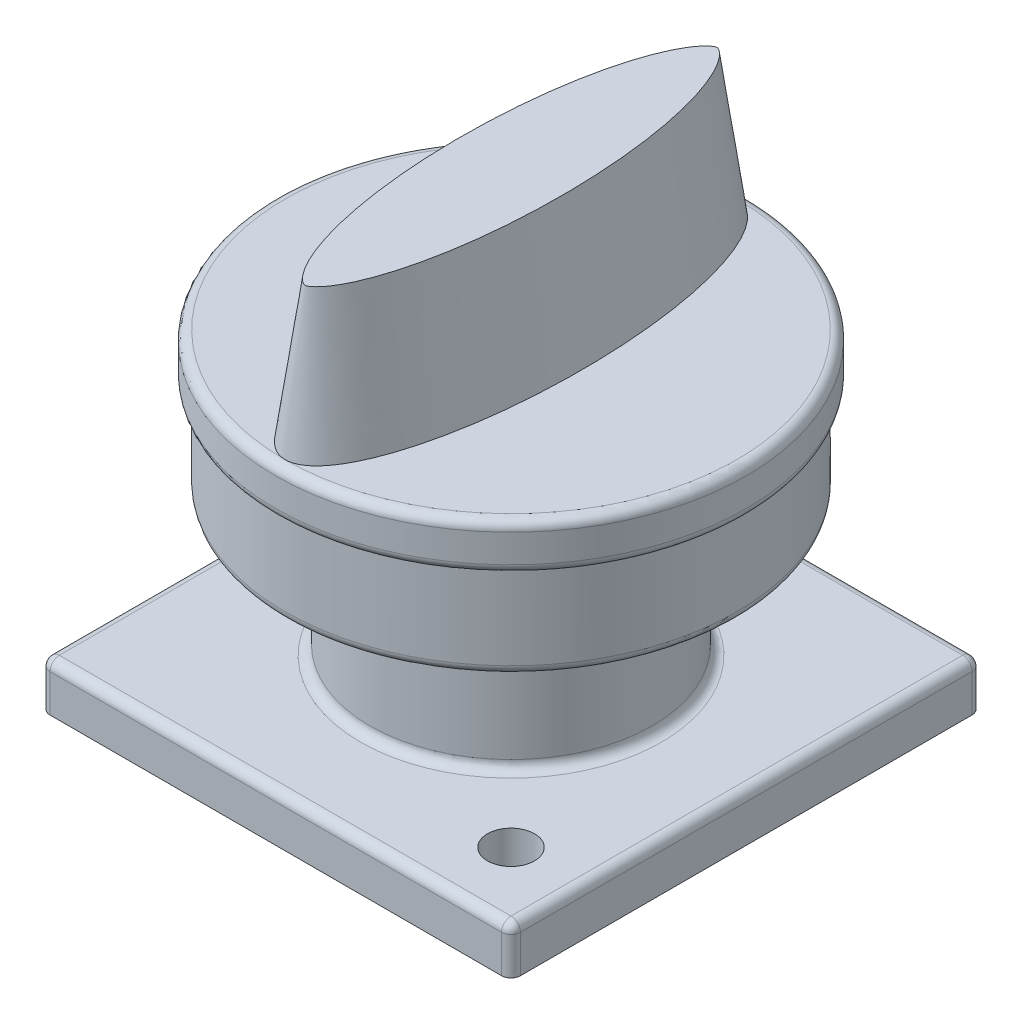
ISO-10303-21;
HEADER;
FILE_DESCRIPTION(('STEP AP214'),'2;1');
FILE_NAME('part.step','',(''),(''),'','','');
FILE_SCHEMA(('AUTOMOTIVE_DESIGN { 1 0 10303 214 1 1 1 1 }'));
ENDSEC;
DATA;
#1=APPLICATION_CONTEXT('core data for automotive mechanical design processes');
#2=APPLICATION_PROTOCOL_DEFINITION('international standard','automotive_design',2000,#1);
#3=PRODUCT_CONTEXT('',#1,'mechanical');
#4=PRODUCT('Part','Part','',(#3));
#5=PRODUCT_RELATED_PRODUCT_CATEGORY('part','',(#4));
#6=PRODUCT_DEFINITION_FORMATION('','',#4);
#7=PRODUCT_DEFINITION_CONTEXT('part definition',#1,'design');
#8=PRODUCT_DEFINITION('design','',#6,#7);
#9=PRODUCT_DEFINITION_SHAPE('','',#8);
#10=(LENGTH_UNIT() NAMED_UNIT(*) SI_UNIT(.MILLI.,.METRE.));
#11=(NAMED_UNIT(*) PLANE_ANGLE_UNIT() SI_UNIT($,.RADIAN.));
#12=(NAMED_UNIT(*) SI_UNIT($,.STERADIAN.) SOLID_ANGLE_UNIT());
#13=UNCERTAINTY_MEASURE_WITH_UNIT(LENGTH_MEASURE(1.E-05),#10,'distance_accuracy_value','');
#14=(GEOMETRIC_REPRESENTATION_CONTEXT(3) GLOBAL_UNCERTAINTY_ASSIGNED_CONTEXT((#13)) GLOBAL_UNIT_ASSIGNED_CONTEXT((#10,
#11,#12)) REPRESENTATION_CONTEXT('',''));
#15=CARTESIAN_POINT('',(0.,0.,0.));
#16=DIRECTION('',(0.,0.,1.));
#17=DIRECTION('',(1.,0.,0.));
#18=AXIS2_PLACEMENT_3D('',#15,#16,#17);
#19=CARTESIAN_POINT('',(25.,5.,-25.));
#20=DIRECTION('',(-1.,0.,0.));
#21=DIRECTION('',(0.,0.,1.));
#22=AXIS2_PLACEMENT_3D('',#19,#20,#21);
#23=PLANE('',#22);
#24=DIRECTION('',(0.,0.,-1.));
#25=VECTOR('',#24,1.);
#26=CARTESIAN_POINT('',(25.,4.,25.));
#27=LINE('',#26,#25);
#28=CARTESIAN_POINT('',(25.,4.,-24.));
#29=VERTEX_POINT('',#28);
#30=CARTESIAN_POINT('',(25.,4.,24.));
#31=VERTEX_POINT('',#30);
#32=EDGE_CURVE('E159',#29,#31,#27,.F.);
#33=ORIENTED_EDGE('',*,*,#32,.T.);
#34=DIRECTION('',(0.,-1.,0.));
#35=VECTOR('',#34,1.);
#36=CARTESIAN_POINT('',(25.,5.,24.));
#37=LINE('',#36,#35);
#38=CARTESIAN_POINT('',(25.,0.,24.));
#39=VERTEX_POINT('',#38);
#40=EDGE_CURVE('E57',#31,#39,#37,.T.);
#41=ORIENTED_EDGE('',*,*,#40,.T.);
#42=DIRECTION('',(0.,0.,-1.));
#43=VECTOR('',#42,1.);
#44=CARTESIAN_POINT('',(25.,0.,-25.));
#45=LINE('',#44,#43);
#46=CARTESIAN_POINT('',(25.,0.,-24.));
#47=VERTEX_POINT('',#46);
#48=EDGE_CURVE('E211',#39,#47,#45,.T.);
#49=ORIENTED_EDGE('',*,*,#48,.T.);
#50=DIRECTION('',(0.,-1.,0.));
#51=VECTOR('',#50,1.);
#52=CARTESIAN_POINT('',(25.,5.,-24.));
#53=LINE('',#52,#51);
#54=EDGE_CURVE('E157',#47,#29,#53,.F.);
#55=ORIENTED_EDGE('',*,*,#54,.T.);
#56=EDGE_LOOP('',(#33,#41,#49,#55));
#57=FACE_BOUND('',#56,.T.);
#58=ADVANCED_FACE('F34',(#57),#23,.F.);
#59=CARTESIAN_POINT('',(-25.,5.,-25.));
#60=DIRECTION('',(0.,0.,1.));
#61=DIRECTION('',(1.,0.,0.));
#62=AXIS2_PLACEMENT_3D('',#59,#60,#61);
#63=PLANE('',#62);
#64=DIRECTION('',(-1.,0.,0.));
#65=VECTOR('',#64,1.);
#66=CARTESIAN_POINT('',(-25.,0.,-25.));
#67=LINE('',#66,#65);
#68=CARTESIAN_POINT('',(24.,0.,-25.));
#69=VERTEX_POINT('',#68);
#70=CARTESIAN_POINT('',(-24.,0.,-25.));
#71=VERTEX_POINT('',#70);
#72=EDGE_CURVE('E270',#69,#71,#67,.T.);
#73=ORIENTED_EDGE('',*,*,#72,.T.);
#74=DIRECTION('',(0.,-1.,0.));
#75=VECTOR('',#74,1.);
#76=CARTESIAN_POINT('',(-24.,5.,-25.));
#77=LINE('',#76,#75);
#78=CARTESIAN_POINT('',(-24.,4.,-25.));
#79=VERTEX_POINT('',#78);
#80=EDGE_CURVE('E165',#71,#79,#77,.F.);
#81=ORIENTED_EDGE('',*,*,#80,.T.);
#82=DIRECTION('',(-1.,0.,0.));
#83=VECTOR('',#82,1.);
#84=CARTESIAN_POINT('',(25.,4.,-25.));
#85=LINE('',#84,#83);
#86=CARTESIAN_POINT('',(24.,4.,-25.));
#87=VERTEX_POINT('',#86);
#88=EDGE_CURVE('E163',#79,#87,#85,.F.);
#89=ORIENTED_EDGE('',*,*,#88,.T.);
#90=DIRECTION('',(0.,-1.,0.));
#91=VECTOR('',#90,1.);
#92=CARTESIAN_POINT('',(24.,5.,-25.));
#93=LINE('',#92,#91);
#94=EDGE_CURVE('E161',#87,#69,#93,.T.);
#95=ORIENTED_EDGE('',*,*,#94,.T.);
#96=EDGE_LOOP('',(#73,#81,#89,#95));
#97=FACE_BOUND('',#96,.T.);
#98=ADVANCED_FACE('F298',(#97),#63,.F.);
#99=CARTESIAN_POINT('',(-25.,5.,-25.));
#100=DIRECTION('',(1.,0.,0.));
#101=DIRECTION('',(0.,0.,-1.));
#102=AXIS2_PLACEMENT_3D('',#99,#100,#101);
#103=PLANE('',#102);
#104=DIRECTION('',(0.,0.,1.));
#105=VECTOR('',#104,1.);
#106=CARTESIAN_POINT('',(-25.,0.,-25.));
#107=LINE('',#106,#105);
#108=CARTESIAN_POINT('',(-25.,0.,-24.));
#109=VERTEX_POINT('',#108);
#110=CARTESIAN_POINT('',(-25.,0.,24.));
#111=VERTEX_POINT('',#110);
#112=EDGE_CURVE('E264',#109,#111,#107,.T.);
#113=ORIENTED_EDGE('',*,*,#112,.T.);
#114=DIRECTION('',(0.,-1.,0.));
#115=VECTOR('',#114,1.);
#116=CARTESIAN_POINT('',(-25.,5.,24.));
#117=LINE('',#116,#115);
#118=CARTESIAN_POINT('',(-25.,4.,24.));
#119=VERTEX_POINT('',#118);
#120=EDGE_CURVE('E171',#111,#119,#117,.F.);
#121=ORIENTED_EDGE('',*,*,#120,.T.);
#122=DIRECTION('',(0.,0.,1.));
#123=VECTOR('',#122,1.);
#124=CARTESIAN_POINT('',(-25.,4.,-25.));
#125=LINE('',#124,#123);
#126=CARTESIAN_POINT('',(-25.,4.,-24.));
#127=VERTEX_POINT('',#126);
#128=EDGE_CURVE('E169',#119,#127,#125,.F.);
#129=ORIENTED_EDGE('',*,*,#128,.T.);
#130=DIRECTION('',(0.,-1.,0.));
#131=VECTOR('',#130,1.);
#132=CARTESIAN_POINT('',(-25.,5.,-24.));
#133=LINE('',#132,#131);
#134=EDGE_CURVE('E167',#127,#109,#133,.T.);
#135=ORIENTED_EDGE('',*,*,#134,.T.);
#136=EDGE_LOOP('',(#113,#121,#129,#135));
#137=FACE_BOUND('',#136,.T.);
#138=ADVANCED_FACE('F302',(#137),#103,.F.);
#139=CARTESIAN_POINT('',(-25.,5.,25.));
#140=DIRECTION('',(0.,0.,-1.));
#141=DIRECTION('',(-1.,0.,0.));
#142=AXIS2_PLACEMENT_3D('',#139,#140,#141);
#143=PLANE('',#142);
#144=DIRECTION('',(1.,0.,0.));
#145=VECTOR('',#144,1.);
#146=CARTESIAN_POINT('',(-25.,0.,25.));
#147=LINE('',#146,#145);
#148=CARTESIAN_POINT('',(-24.,0.,25.));
#149=VERTEX_POINT('',#148);
#150=CARTESIAN_POINT('',(24.,0.,25.));
#151=VERTEX_POINT('',#150);
#152=EDGE_CURVE('E261',#149,#151,#147,.T.);
#153=ORIENTED_EDGE('',*,*,#152,.T.);
#154=DIRECTION('',(0.,-1.,0.));
#155=VECTOR('',#154,1.);
#156=CARTESIAN_POINT('',(24.,5.,25.));
#157=LINE('',#156,#155);
#158=CARTESIAN_POINT('',(24.,4.,25.));
#159=VERTEX_POINT('',#158);
#160=EDGE_CURVE('E11',#151,#159,#157,.F.);
#161=ORIENTED_EDGE('',*,*,#160,.T.);
#162=DIRECTION('',(1.,0.,0.));
#163=VECTOR('',#162,1.);
#164=CARTESIAN_POINT('',(-25.,4.,25.));
#165=LINE('',#164,#163);
#166=CARTESIAN_POINT('',(-24.,4.,25.));
#167=VERTEX_POINT('',#166);
#168=EDGE_CURVE('E175',#159,#167,#165,.F.);
#169=ORIENTED_EDGE('',*,*,#168,.T.);
#170=DIRECTION('',(0.,-1.,0.));
#171=VECTOR('',#170,1.);
#172=CARTESIAN_POINT('',(-24.,5.,25.));
#173=LINE('',#172,#171);
#174=EDGE_CURVE('E173',#167,#149,#173,.T.);
#175=ORIENTED_EDGE('',*,*,#174,.T.);
#176=EDGE_LOOP('',(#153,#161,#169,#175));
#177=FACE_BOUND('',#176,.T.);
#178=ADVANCED_FACE('F259',(#177),#143,.F.);
#179=CARTESIAN_POINT('',(0.,5.,0.));
#180=DIRECTION('',(0.,1.,0.));
#181=DIRECTION('',(0.,0.,1.));
#182=AXIS2_PLACEMENT_3D('',#179,#180,#181);
#183=PLANE('',#182);
#184=CARTESIAN_POINT('',(-17.6776695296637,5.,-17.6776695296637));
#185=DIRECTION('',(0.,1.,0.));
#186=DIRECTION('',(0.,0.,1.));
#187=AXIS2_PLACEMENT_3D('',#184,#185,#186);
#188=CIRCLE('',#187,2.5);
#189=CARTESIAN_POINT('',(-17.6776695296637,5.,-15.1776695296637));
#190=VERTEX_POINT('',#189);
#191=EDGE_CURVE('E215',#190,#190,#188,.T.);
#192=ORIENTED_EDGE('',*,*,#191,.F.);
#193=EDGE_LOOP('',(#192));
#194=FACE_BOUND('',#193,.T.);
#195=CARTESIAN_POINT('',(17.6776695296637,5.,17.6776695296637));
#196=DIRECTION('',(0.,1.,0.));
#197=DIRECTION('',(0.,0.,1.));
#198=AXIS2_PLACEMENT_3D('',#195,#196,#197);
#199=CIRCLE('',#198,2.5);
#200=CARTESIAN_POINT('',(17.6776695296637,5.,20.1776695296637));
#201=VERTEX_POINT('',#200);
#202=EDGE_CURVE('E256',#201,#201,#199,.T.);
#203=ORIENTED_EDGE('',*,*,#202,.F.);
#204=EDGE_LOOP('',(#203));
#205=FACE_BOUND('',#204,.T.);
#206=DIRECTION('',(1.,0.,0.));
#207=VECTOR('',#206,1.);
#208=CARTESIAN_POINT('',(25.,5.,24.));
#209=LINE('',#208,#207);
#210=CARTESIAN_POINT('',(-24.,5.,24.));
#211=VERTEX_POINT('',#210);
#212=CARTESIAN_POINT('',(24.,5.,24.));
#213=VERTEX_POINT('',#212);
#214=EDGE_CURVE('E147',#211,#213,#209,.T.);
#215=ORIENTED_EDGE('',*,*,#214,.T.);
#216=DIRECTION('',(0.,0.,-1.));
#217=VECTOR('',#216,1.);
#218=CARTESIAN_POINT('',(24.,5.,-25.));
#219=LINE('',#218,#217);
#220=CARTESIAN_POINT('',(24.,5.,-24.));
#221=VERTEX_POINT('',#220);
#222=EDGE_CURVE('E154',#213,#221,#219,.T.);
#223=ORIENTED_EDGE('',*,*,#222,.T.);
#224=DIRECTION('',(-1.,0.,0.));
#225=VECTOR('',#224,1.);
#226=CARTESIAN_POINT('',(-25.,5.,-24.));
#227=LINE('',#226,#225);
#228=CARTESIAN_POINT('',(-24.,5.,-24.));
#229=VERTEX_POINT('',#228);
#230=EDGE_CURVE('E152',#221,#229,#227,.T.);
#231=ORIENTED_EDGE('',*,*,#230,.T.);
#232=DIRECTION('',(0.,0.,1.));
#233=VECTOR('',#232,1.);
#234=CARTESIAN_POINT('',(-24.,5.,25.));
#235=LINE('',#234,#233);
#236=EDGE_CURVE('E150',#229,#211,#235,.T.);
#237=ORIENTED_EDGE('',*,*,#236,.T.);
#238=EDGE_LOOP('',(#215,#223,#231,#237));
#239=FACE_BOUND('',#238,.T.);
#240=CARTESIAN_POINT('',(0.,5.,0.));
#241=DIRECTION('',(0.,1.,0.));
#242=DIRECTION('',(0.,0.,1.));
#243=AXIS2_PLACEMENT_3D('',#240,#241,#242);
#244=CIRCLE('',#243,16.);
#245=CARTESIAN_POINT('',(0.,5.,16.));
#246=VERTEX_POINT('',#245);
#247=EDGE_CURVE('E140',#246,#246,#244,.F.);
#248=ORIENTED_EDGE('',*,*,#247,.T.);
#249=EDGE_LOOP('',(#248));
#250=FACE_BOUND('',#249,.T.);
#251=ADVANCED_FACE('F245',(#194,#205,#239,#250),#183,.T.);
#252=CARTESIAN_POINT('',(0.,0.,0.));
#253=DIRECTION('',(0.,1.,0.));
#254=DIRECTION('',(0.,0.,1.));
#255=AXIS2_PLACEMENT_3D('',#252,#253,#254);
#256=PLANE('',#255);
#257=CARTESIAN_POINT('',(0.,0.,7.5));
#258=DIRECTION('',(0.,-1.,0.));
#259=DIRECTION('',(0.,0.,-1.));
#260=AXIS2_PLACEMENT_3D('',#257,#258,#259);
#261=CIRCLE('',#260,1.5);
#262=CARTESIAN_POINT('',(0.,0.,6.));
#263=VERTEX_POINT('',#262);
#264=EDGE_CURVE('E744',#263,#263,#261,.T.);
#265=ORIENTED_EDGE('',*,*,#264,.F.);
#266=EDGE_LOOP('',(#265));
#267=FACE_BOUND('',#266,.T.);
#268=CARTESIAN_POINT('',(-6.49519052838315,0.,3.74999999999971));
#269=DIRECTION('',(0.,-1.,0.));
#270=DIRECTION('',(0.,0.,-1.));
#271=AXIS2_PLACEMENT_3D('',#268,#269,#270);
#272=CIRCLE('',#271,1.5);
#273=CARTESIAN_POINT('',(-6.49519052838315,0.,2.24999999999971));
#274=VERTEX_POINT('',#273);
#275=EDGE_CURVE('E754',#274,#274,#272,.T.);
#276=ORIENTED_EDGE('',*,*,#275,.F.);
#277=EDGE_LOOP('',(#276));
#278=FACE_BOUND('',#277,.T.);
#279=CARTESIAN_POINT('',(-6.49519052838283,0.,-3.75000000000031));
#280=DIRECTION('',(0.,-1.,0.));
#281=DIRECTION('',(0.,0.,-1.));
#282=AXIS2_PLACEMENT_3D('',#279,#280,#281);
#283=CIRCLE('',#282,1.5);
#284=CARTESIAN_POINT('',(-6.49519052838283,0.,-5.25000000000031));
#285=VERTEX_POINT('',#284);
#286=EDGE_CURVE('E753',#285,#285,#283,.T.);
#287=ORIENTED_EDGE('',*,*,#286,.F.);
#288=EDGE_LOOP('',(#287));
#289=FACE_BOUND('',#288,.T.);
#290=CARTESIAN_POINT('',(6.33824590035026E-13,0.,-7.50000000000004));
#291=DIRECTION('',(0.,-1.,0.));
#292=DIRECTION('',(0.,0.,-1.));
#293=AXIS2_PLACEMENT_3D('',#290,#291,#292);
#294=CIRCLE('',#293,1.5);
#295=CARTESIAN_POINT('',(6.33824590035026E-13,0.,-9.00000000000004));
#296=VERTEX_POINT('',#295);
#297=EDGE_CURVE('E771',#296,#296,#294,.T.);
#298=ORIENTED_EDGE('',*,*,#297,.F.);
#299=EDGE_LOOP('',(#298));
#300=FACE_BOUND('',#299,.T.);
#301=CARTESIAN_POINT('',(6.49519052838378,0.,-3.74999999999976));
#302=DIRECTION('',(0.,-1.,0.));
#303=DIRECTION('',(0.,0.,-1.));
#304=AXIS2_PLACEMENT_3D('',#301,#302,#303);
#305=CIRCLE('',#304,1.5);
#306=CARTESIAN_POINT('',(6.49519052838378,0.,-5.24999999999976));
#307=VERTEX_POINT('',#306);
#308=EDGE_CURVE('E765',#307,#307,#305,.T.);
#309=ORIENTED_EDGE('',*,*,#308,.F.);
#310=EDGE_LOOP('',(#309));
#311=FACE_BOUND('',#310,.T.);
#312=CARTESIAN_POINT('',(6.49519052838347,0.,3.75000000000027));
#313=DIRECTION('',(0.,-1.,0.));
#314=DIRECTION('',(0.,0.,-1.));
#315=AXIS2_PLACEMENT_3D('',#312,#313,#314);
#316=CIRCLE('',#315,1.5);
#317=CARTESIAN_POINT('',(6.49519052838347,0.,2.25000000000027));
#318=VERTEX_POINT('',#317);
#319=EDGE_CURVE('E759',#318,#318,#316,.T.);
#320=ORIENTED_EDGE('',*,*,#319,.F.);
#321=EDGE_LOOP('',(#320));
#322=FACE_BOUND('',#321,.T.);
#323=CARTESIAN_POINT('',(-17.6776695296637,0.,-17.6776695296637));
#324=DIRECTION('',(0.,1.,0.));
#325=DIRECTION('',(0.,0.,1.));
#326=AXIS2_PLACEMENT_3D('',#323,#324,#325);
#327=CIRCLE('',#326,2.5);
#328=CARTESIAN_POINT('',(-17.6776695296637,0.,-15.1776695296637));
#329=VERTEX_POINT('',#328);
#330=EDGE_CURVE('E124',#329,#329,#327,.T.);
#331=ORIENTED_EDGE('',*,*,#330,.T.);
#332=EDGE_LOOP('',(#331));
#333=FACE_BOUND('',#332,.T.);
#334=CARTESIAN_POINT('',(17.6776695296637,0.,17.6776695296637));
#335=DIRECTION('',(0.,1.,0.));
#336=DIRECTION('',(0.,0.,1.));
#337=AXIS2_PLACEMENT_3D('',#334,#335,#336);
#338=CIRCLE('',#337,2.5);
#339=CARTESIAN_POINT('',(17.6776695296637,0.,20.1776695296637));
#340=VERTEX_POINT('',#339);
#341=EDGE_CURVE('E212',#340,#340,#338,.T.);
#342=ORIENTED_EDGE('',*,*,#341,.T.);
#343=EDGE_LOOP('',(#342));
#344=FACE_BOUND('',#343,.T.);
#345=ORIENTED_EDGE('',*,*,#48,.F.);
#346=CARTESIAN_POINT('',(24.,0.,24.));
#347=DIRECTION('',(0.,1.,0.));
#348=DIRECTION('',(0.,0.,1.));
#349=AXIS2_PLACEMENT_3D('',#346,#347,#348);
#350=CIRCLE('',#349,1.);
#351=EDGE_CURVE('E43',#39,#151,#350,.F.);
#352=ORIENTED_EDGE('',*,*,#351,.T.);
#353=ORIENTED_EDGE('',*,*,#152,.F.);
#354=CARTESIAN_POINT('',(-24.,0.,24.));
#355=DIRECTION('',(0.,1.,0.));
#356=DIRECTION('',(0.,0.,1.));
#357=AXIS2_PLACEMENT_3D('',#354,#355,#356);
#358=CIRCLE('',#357,1.);
#359=EDGE_CURVE('E182',#149,#111,#358,.F.);
#360=ORIENTED_EDGE('',*,*,#359,.T.);
#361=ORIENTED_EDGE('',*,*,#112,.F.);
#362=CARTESIAN_POINT('',(-24.,0.,-24.));
#363=DIRECTION('',(0.,1.,0.));
#364=DIRECTION('',(0.,0.,1.));
#365=AXIS2_PLACEMENT_3D('',#362,#363,#364);
#366=CIRCLE('',#365,1.);
#367=EDGE_CURVE('E180',#109,#71,#366,.F.);
#368=ORIENTED_EDGE('',*,*,#367,.T.);
#369=ORIENTED_EDGE('',*,*,#72,.F.);
#370=CARTESIAN_POINT('',(24.,0.,-24.));
#371=DIRECTION('',(0.,1.,0.));
#372=DIRECTION('',(0.,0.,1.));
#373=AXIS2_PLACEMENT_3D('',#370,#371,#372);
#374=CIRCLE('',#373,1.);
#375=EDGE_CURVE('E177',#69,#47,#374,.F.);
#376=ORIENTED_EDGE('',*,*,#375,.T.);
#377=EDGE_LOOP('',(#345,#352,#353,#360,#361,#368,#369,#376));
#378=FACE_BOUND('',#377,.T.);
#379=ADVANCED_FACE('F311',(#267,#278,#289,#300,#311,#322,#333,#344,#378),#256,.F.);
#380=CARTESIAN_POINT('',(0.,30.,0.));
#381=DIRECTION('',(0.,-1.,0.));
#382=DIRECTION('',(0.,0.,-1.));
#383=AXIS2_PLACEMENT_3D('',#380,#381,#382);
#384=CYLINDRICAL_SURFACE('',#383,15.);
#385=CARTESIAN_POINT('',(0.,19.,0.));
#386=DIRECTION('',(0.,-1.,0.));
#387=DIRECTION('',(0.,0.,-1.));
#388=AXIS2_PLACEMENT_3D('',#385,#386,#387);
#389=CIRCLE('',#388,15.);
#390=CARTESIAN_POINT('',(0.,19.,-15.));
#391=VERTEX_POINT('',#390);
#392=EDGE_CURVE('E226',#391,#391,#389,.T.);
#393=ORIENTED_EDGE('',*,*,#392,.T.);
#394=EDGE_LOOP('',(#393));
#395=FACE_BOUND('',#394,.T.);
#396=CARTESIAN_POINT('',(0.,6.,0.));
#397=DIRECTION('',(0.,1.,0.));
#398=DIRECTION('',(0.,0.,1.));
#399=AXIS2_PLACEMENT_3D('',#396,#397,#398);
#400=CIRCLE('',#399,15.);
#401=CARTESIAN_POINT('',(0.,6.,15.));
#402=VERTEX_POINT('',#401);
#403=EDGE_CURVE('E138',#402,#402,#400,.T.);
#404=ORIENTED_EDGE('',*,*,#403,.T.);
#405=EDGE_LOOP('',(#404));
#406=FACE_BOUND('',#405,.T.);
#407=ADVANCED_FACE('F314',(#395,#406),#384,.T.);
#408=CARTESIAN_POINT('',(-24.,5.,-24.));
#409=DIRECTION('',(0.,-1.,0.));
#410=DIRECTION('',(0.,0.,-1.));
#411=AXIS2_PLACEMENT_3D('',#408,#409,#410);
#412=CYLINDRICAL_SURFACE('',#411,1.);
#413=ORIENTED_EDGE('',*,*,#367,.F.);
#414=ORIENTED_EDGE('',*,*,#134,.F.);
#415=CARTESIAN_POINT('',(-24.,4.,-24.));
#416=DIRECTION('',(0.,1.,0.));
#417=DIRECTION('',(0.,0.,1.));
#418=AXIS2_PLACEMENT_3D('',#415,#416,#417);
#419=CIRCLE('',#418,1.);
#420=EDGE_CURVE('E205',#79,#127,#419,.T.);
#421=ORIENTED_EDGE('',*,*,#420,.F.);
#422=ORIENTED_EDGE('',*,*,#80,.F.);
#423=EDGE_LOOP('',(#413,#414,#421,#422));
#424=FACE_BOUND('',#423,.T.);
#425=ADVANCED_FACE('F320',(#424),#412,.T.);
#426=CARTESIAN_POINT('',(-24.,5.,24.));
#427=DIRECTION('',(0.,-1.,0.));
#428=DIRECTION('',(0.,0.,-1.));
#429=AXIS2_PLACEMENT_3D('',#426,#427,#428);
#430=CYLINDRICAL_SURFACE('',#429,1.);
#431=ORIENTED_EDGE('',*,*,#359,.F.);
#432=ORIENTED_EDGE('',*,*,#174,.F.);
#433=CARTESIAN_POINT('',(-24.,4.,24.));
#434=DIRECTION('',(0.,1.,0.));
#435=DIRECTION('',(0.,0.,1.));
#436=AXIS2_PLACEMENT_3D('',#433,#434,#435);
#437=CIRCLE('',#436,1.);
#438=EDGE_CURVE('E202',#119,#167,#437,.T.);
#439=ORIENTED_EDGE('',*,*,#438,.F.);
#440=ORIENTED_EDGE('',*,*,#120,.F.);
#441=EDGE_LOOP('',(#431,#432,#439,#440));
#442=FACE_BOUND('',#441,.T.);
#443=ADVANCED_FACE('F382',(#442),#430,.T.);
#444=CARTESIAN_POINT('',(-24.,4.,0.));
#445=DIRECTION('',(0.,0.,-1.));
#446=DIRECTION('',(-1.,0.,0.));
#447=AXIS2_PLACEMENT_3D('',#444,#445,#446);
#448=CYLINDRICAL_SURFACE('',#447,1.);
#449=CARTESIAN_POINT('',(-24.,4.,-24.));
#450=DIRECTION('',(0.,0.,-1.));
#451=DIRECTION('',(-1.,0.,0.));
#452=AXIS2_PLACEMENT_3D('',#449,#450,#451);
#453=CIRCLE('',#452,1.);
#454=EDGE_CURVE('E208',#127,#229,#453,.T.);
#455=ORIENTED_EDGE('',*,*,#454,.F.);
#456=ORIENTED_EDGE('',*,*,#128,.F.);
#457=CARTESIAN_POINT('',(-24.,4.,24.));
#458=DIRECTION('',(0.,0.,1.));
#459=DIRECTION('',(1.,0.,0.));
#460=AXIS2_PLACEMENT_3D('',#457,#458,#459);
#461=CIRCLE('',#460,1.);
#462=EDGE_CURVE('E199',#211,#119,#461,.T.);
#463=ORIENTED_EDGE('',*,*,#462,.F.);
#464=ORIENTED_EDGE('',*,*,#236,.F.);
#465=EDGE_LOOP('',(#455,#456,#463,#464));
#466=FACE_BOUND('',#465,.T.);
#467=ADVANCED_FACE('F374',(#466),#448,.T.);
#468=CARTESIAN_POINT('',(-24.,4.,-24.));
#469=DIRECTION('',(0.,0.,1.));
#470=DIRECTION('',(1.,0.,0.));
#471=AXIS2_PLACEMENT_3D('',#468,#469,#470);
#472=SPHERICAL_SURFACE('',#471,1.);
#473=ORIENTED_EDGE('',*,*,#420,.T.);
#474=ORIENTED_EDGE('',*,*,#454,.T.);
#475=CARTESIAN_POINT('',(-24.,4.,-24.));
#476=DIRECTION('',(-1.,0.,0.));
#477=DIRECTION('',(0.,0.,1.));
#478=AXIS2_PLACEMENT_3D('',#475,#476,#477);
#479=CIRCLE('',#478,1.);
#480=EDGE_CURVE('E196',#79,#229,#479,.F.);
#481=ORIENTED_EDGE('',*,*,#480,.F.);
#482=EDGE_LOOP('',(#473,#474,#481));
#483=FACE_BOUND('',#482,.T.);
#484=ADVANCED_FACE('F362',(#483),#472,.T.);
#485=CARTESIAN_POINT('',(-24.,4.,24.));
#486=DIRECTION('',(0.,0.,1.));
#487=DIRECTION('',(1.,0.,0.));
#488=AXIS2_PLACEMENT_3D('',#485,#486,#487);
#489=SPHERICAL_SURFACE('',#488,1.);
#490=ORIENTED_EDGE('',*,*,#462,.T.);
#491=ORIENTED_EDGE('',*,*,#438,.T.);
#492=CARTESIAN_POINT('',(-24.,4.,24.));
#493=DIRECTION('',(-1.,0.,0.));
#494=DIRECTION('',(0.,0.,1.));
#495=AXIS2_PLACEMENT_3D('',#492,#493,#494);
#496=CIRCLE('',#495,1.);
#497=EDGE_CURVE('E193',#211,#167,#496,.F.);
#498=ORIENTED_EDGE('',*,*,#497,.F.);
#499=EDGE_LOOP('',(#490,#491,#498));
#500=FACE_BOUND('',#499,.T.);
#501=ADVANCED_FACE('F379',(#500),#489,.T.);
#502=CARTESIAN_POINT('',(0.,4.,-24.));
#503=DIRECTION('',(1.,0.,0.));
#504=DIRECTION('',(0.,0.,-1.));
#505=AXIS2_PLACEMENT_3D('',#502,#503,#504);
#506=CYLINDRICAL_SURFACE('',#505,1.);
#507=ORIENTED_EDGE('',*,*,#480,.T.);
#508=ORIENTED_EDGE('',*,*,#230,.F.);
#509=CARTESIAN_POINT('',(24.,4.,-24.));
#510=DIRECTION('',(1.,0.,0.));
#511=DIRECTION('',(0.,0.,-1.));
#512=AXIS2_PLACEMENT_3D('',#509,#510,#511);
#513=CIRCLE('',#512,1.);
#514=EDGE_CURVE('E190',#87,#221,#513,.T.);
#515=ORIENTED_EDGE('',*,*,#514,.F.);
#516=ORIENTED_EDGE('',*,*,#88,.F.);
#517=EDGE_LOOP('',(#507,#508,#515,#516));
#518=FACE_BOUND('',#517,.T.);
#519=ADVANCED_FACE('F366',(#518),#506,.T.);
#520=CARTESIAN_POINT('',(24.,5.,-24.));
#521=DIRECTION('',(0.,-1.,0.));
#522=DIRECTION('',(0.,0.,-1.));
#523=AXIS2_PLACEMENT_3D('',#520,#521,#522);
#524=CYLINDRICAL_SURFACE('',#523,1.);
#525=ORIENTED_EDGE('',*,*,#375,.F.);
#526=ORIENTED_EDGE('',*,*,#94,.F.);
#527=CARTESIAN_POINT('',(24.,4.,-24.));
#528=DIRECTION('',(0.,1.,0.));
#529=DIRECTION('',(0.,0.,1.));
#530=AXIS2_PLACEMENT_3D('',#527,#528,#529);
#531=CIRCLE('',#530,1.);
#532=EDGE_CURVE('E187',#29,#87,#531,.T.);
#533=ORIENTED_EDGE('',*,*,#532,.F.);
#534=ORIENTED_EDGE('',*,*,#54,.F.);
#535=EDGE_LOOP('',(#525,#526,#533,#534));
#536=FACE_BOUND('',#535,.T.);
#537=ADVANCED_FACE('F369',(#536),#524,.T.);
#538=CARTESIAN_POINT('',(0.,4.,24.));
#539=DIRECTION('',(-1.,0.,0.));
#540=DIRECTION('',(0.,0.,1.));
#541=AXIS2_PLACEMENT_3D('',#538,#539,#540);
#542=CYLINDRICAL_SURFACE('',#541,1.);
#543=ORIENTED_EDGE('',*,*,#168,.F.);
#544=CARTESIAN_POINT('',(24.,4.,24.));
#545=DIRECTION('',(-1.,0.,0.));
#546=DIRECTION('',(0.,0.,1.));
#547=AXIS2_PLACEMENT_3D('',#544,#545,#546);
#548=CIRCLE('',#547,1.);
#549=EDGE_CURVE('E232',#159,#213,#548,.T.);
#550=ORIENTED_EDGE('',*,*,#549,.T.);
#551=ORIENTED_EDGE('',*,*,#214,.F.);
#552=ORIENTED_EDGE('',*,*,#497,.T.);
#553=EDGE_LOOP('',(#543,#550,#551,#552));
#554=FACE_BOUND('',#553,.T.);
#555=ADVANCED_FACE('F239',(#554),#542,.T.);
#556=CARTESIAN_POINT('',(24.,4.,-24.));
#557=DIRECTION('',(0.,0.,1.));
#558=DIRECTION('',(1.,0.,0.));
#559=AXIS2_PLACEMENT_3D('',#556,#557,#558);
#560=SPHERICAL_SURFACE('',#559,1.);
#561=ORIENTED_EDGE('',*,*,#532,.T.);
#562=ORIENTED_EDGE('',*,*,#514,.T.);
#563=CARTESIAN_POINT('',(24.,4.,-24.));
#564=DIRECTION('',(0.,0.,-1.));
#565=DIRECTION('',(-1.,0.,0.));
#566=AXIS2_PLACEMENT_3D('',#563,#564,#565);
#567=CIRCLE('',#566,1.);
#568=EDGE_CURVE('E185',#29,#221,#567,.F.);
#569=ORIENTED_EDGE('',*,*,#568,.F.);
#570=EDGE_LOOP('',(#561,#562,#569));
#571=FACE_BOUND('',#570,.T.);
#572=ADVANCED_FACE('F372',(#571),#560,.T.);
#573=CARTESIAN_POINT('',(24.,4.,0.));
#574=DIRECTION('',(0.,0.,1.));
#575=DIRECTION('',(1.,0.,0.));
#576=AXIS2_PLACEMENT_3D('',#573,#574,#575);
#577=CYLINDRICAL_SURFACE('',#576,1.);
#578=ORIENTED_EDGE('',*,*,#222,.F.);
#579=CARTESIAN_POINT('',(24.,4.,24.));
#580=DIRECTION('',(0.,0.,1.));
#581=DIRECTION('',(1.,0.,0.));
#582=AXIS2_PLACEMENT_3D('',#579,#580,#581);
#583=CIRCLE('',#582,1.);
#584=EDGE_CURVE('E229',#213,#31,#583,.F.);
#585=ORIENTED_EDGE('',*,*,#584,.T.);
#586=ORIENTED_EDGE('',*,*,#32,.F.);
#587=ORIENTED_EDGE('',*,*,#568,.T.);
#588=EDGE_LOOP('',(#578,#585,#586,#587));
#589=FACE_BOUND('',#588,.T.);
#590=ADVANCED_FACE('F250',(#589),#577,.T.);
#591=CARTESIAN_POINT('',(0.,6.,0.));
#592=DIRECTION('',(0.,1.,0.));
#593=DIRECTION('',(0.,0.,1.));
#594=AXIS2_PLACEMENT_3D('',#591,#592,#593);
#595=TOROIDAL_SURFACE('',#594,16.,1.);
#596=ORIENTED_EDGE('',*,*,#247,.F.);
#597=EDGE_LOOP('',(#596));
#598=FACE_BOUND('',#597,.T.);
#599=ORIENTED_EDGE('',*,*,#403,.F.);
#600=EDGE_LOOP('',(#599));
#601=FACE_BOUND('',#600,.T.);
#602=ADVANCED_FACE('F394',(#598,#601),#595,.F.);
#603=CARTESIAN_POINT('',(17.6776695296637,-10.,17.6776695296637));
#604=DIRECTION('',(0.,1.,0.));
#605=DIRECTION('',(0.,0.,1.));
#606=AXIS2_PLACEMENT_3D('',#603,#604,#605);
#607=CYLINDRICAL_SURFACE('',#606,2.5);
#608=ORIENTED_EDGE('',*,*,#202,.T.);
#609=EDGE_LOOP('',(#608));
#610=FACE_BOUND('',#609,.T.);
#611=ORIENTED_EDGE('',*,*,#341,.F.);
#612=EDGE_LOOP('',(#611));
#613=FACE_BOUND('',#612,.T.);
#614=ADVANCED_FACE('F396',(#610,#613),#607,.F.);
#615=CARTESIAN_POINT('',(-17.6776695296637,-10.,-17.6776695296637));
#616=DIRECTION('',(0.,1.,0.));
#617=DIRECTION('',(0.,0.,1.));
#618=AXIS2_PLACEMENT_3D('',#615,#616,#617);
#619=CYLINDRICAL_SURFACE('',#618,2.5);
#620=ORIENTED_EDGE('',*,*,#191,.T.);
#621=EDGE_LOOP('',(#620));
#622=FACE_BOUND('',#621,.T.);
#623=ORIENTED_EDGE('',*,*,#330,.F.);
#624=EDGE_LOOP('',(#623));
#625=FACE_BOUND('',#624,.T.);
#626=ADVANCED_FACE('F441',(#622,#625),#619,.F.);
#627=CARTESIAN_POINT('',(0.,20.,0.));
#628=DIRECTION('',(0.,1.,0.));
#629=DIRECTION('',(0.,0.,1.));
#630=AXIS2_PLACEMENT_3D('',#627,#628,#629);
#631=CYLINDRICAL_SURFACE('',#630,24.);
#632=CARTESIAN_POINT('',(0.,21.,0.));
#633=DIRECTION('',(0.,-1.,0.));
#634=DIRECTION('',(0.,0.,-1.));
#635=AXIS2_PLACEMENT_3D('',#632,#633,#634);
#636=CIRCLE('',#635,24.);
#637=CARTESIAN_POINT('',(0.,21.,-24.));
#638=VERTEX_POINT('',#637);
#639=EDGE_CURVE('E223',#638,#638,#636,.F.);
#640=ORIENTED_EDGE('',*,*,#639,.T.);
#641=EDGE_LOOP('',(#640));
#642=FACE_BOUND('',#641,.T.);
#643=CARTESIAN_POINT('',(0.,30.,0.));
#644=DIRECTION('',(0.,1.,0.));
#645=DIRECTION('',(0.,0.,1.));
#646=AXIS2_PLACEMENT_3D('',#643,#644,#645);
#647=CIRCLE('',#646,24.);
#648=CARTESIAN_POINT('',(0.,30.,24.));
#649=VERTEX_POINT('',#648);
#650=EDGE_CURVE('E135',#649,#649,#647,.F.);
#651=ORIENTED_EDGE('',*,*,#650,.T.);
#652=EDGE_LOOP('',(#651));
#653=FACE_BOUND('',#652,.T.);
#654=ADVANCED_FACE('F279',(#642,#653),#631,.T.);
#655=CARTESIAN_POINT('',(0.,20.,0.));
#656=DIRECTION('',(0.,-1.,0.));
#657=DIRECTION('',(0.,0.,-1.));
#658=AXIS2_PLACEMENT_3D('',#655,#656,#657);
#659=PLANE('',#658);
#660=CARTESIAN_POINT('',(0.,20.,0.));
#661=DIRECTION('',(0.,-1.,0.));
#662=DIRECTION('',(0.,0.,-1.));
#663=AXIS2_PLACEMENT_3D('',#660,#661,#662);
#664=CIRCLE('',#663,23.);
#665=CARTESIAN_POINT('',(0.,20.,-23.));
#666=VERTEX_POINT('',#665);
#667=EDGE_CURVE('E220',#666,#666,#664,.T.);
#668=ORIENTED_EDGE('',*,*,#667,.T.);
#669=EDGE_LOOP('',(#668));
#670=FACE_BOUND('',#669,.T.);
#671=CARTESIAN_POINT('',(0.,20.,0.));
#672=DIRECTION('',(0.,-1.,0.));
#673=DIRECTION('',(0.,0.,-1.));
#674=AXIS2_PLACEMENT_3D('',#671,#672,#673);
#675=CIRCLE('',#674,16.);
#676=CARTESIAN_POINT('',(0.,20.,-16.));
#677=VERTEX_POINT('',#676);
#678=EDGE_CURVE('E184',#677,#677,#675,.F.);
#679=ORIENTED_EDGE('',*,*,#678,.T.);
#680=EDGE_LOOP('',(#679));
#681=FACE_BOUND('',#680,.T.);
#682=ADVANCED_FACE('F427',(#670,#681),#659,.T.);
#683=CARTESIAN_POINT('',(0.,50.,0.));
#684=DIRECTION('',(0.,1.,0.));
#685=DIRECTION('',(0.,0.,1.));
#686=AXIS2_PLACEMENT_3D('',#683,#684,#685);
#687=PLANE('',#686);
#688=CARTESIAN_POINT('',(0.,50.,21.8918874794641));
#689=CARTESIAN_POINT('',(0.00581591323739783,50.,21.8918887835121));
#690=CARTESIAN_POINT('',(0.0116311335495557,50.,21.8917651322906));
#691=CARTESIAN_POINT('',(0.0232328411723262,50.,21.891081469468));
#692=CARTESIAN_POINT('',(0.0290193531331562,50.,21.8905219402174));
#693=CARTESIAN_POINT('',(0.046354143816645,50.,21.8882172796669));
#694=CARTESIAN_POINT('',(0.0578157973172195,50.,21.8858454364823));
#695=CARTESIAN_POINT('',(0.078500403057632,50.,21.8806910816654));
#696=CARTESIAN_POINT('',(0.0877636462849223,50.,21.8780534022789));
#697=CARTESIAN_POINT('',(0.106164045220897,50.,21.872370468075));
#698=CARTESIAN_POINT('',(0.115301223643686,50.,21.869325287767));
#699=CARTESIAN_POINT('',(0.142512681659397,50.,21.8595732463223));
#700=CARTESIAN_POINT('',(0.160367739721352,50.,21.8522548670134));
#701=CARTESIAN_POINT('',(0.195657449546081,50.,21.836447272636));
#702=CARTESIAN_POINT('',(0.21308922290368,50.,21.8279517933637));
#703=CARTESIAN_POINT('',(0.247471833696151,50.,21.8100665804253));
#704=CARTESIAN_POINT('',(0.26442294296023,50.,21.8006773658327));
#705=CARTESIAN_POINT('',(0.332496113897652,50.,21.761071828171));
#706=CARTESIAN_POINT('',(0.381891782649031,50.,21.7278882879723));
#707=CARTESIAN_POINT('',(0.477712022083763,50.,21.6574388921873));
#708=CARTESIAN_POINT('',(0.524130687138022,50.,21.6201652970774));
#709=CARTESIAN_POINT('',(0.614469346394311,50.,21.542726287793));
#710=CARTESIAN_POINT('',(0.658389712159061,50.,21.5025613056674));
#711=CARTESIAN_POINT('',(0.743981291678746,50.,21.4199977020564));
#712=CARTESIAN_POINT('',(0.785654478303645,50.,21.3776011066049));
#713=CARTESIAN_POINT('',(0.889146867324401,50.,21.2677100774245));
#714=CARTESIAN_POINT('',(0.949696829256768,50.,21.1990224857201));
#715=CARTESIAN_POINT('',(1.06716312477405,50.,21.0585912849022));
#716=CARTESIAN_POINT('',(1.12407801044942,50.,20.9868464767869));
#717=CARTESIAN_POINT('',(1.23473869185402,50.,20.8407695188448));
#718=CARTESIAN_POINT('',(1.28847895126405,50.,20.7664331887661));
#719=CARTESIAN_POINT('',(1.39315678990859,50.,20.6158065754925));
#720=CARTESIAN_POINT('',(1.44409388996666,50.,20.5395159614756));
#721=CARTESIAN_POINT('',(1.5936714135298,50.,20.3077170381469));
#722=CARTESIAN_POINT('',(1.68865965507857,50.,20.1498487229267));
#723=CARTESIAN_POINT('',(1.87068114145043,50.,19.8298528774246));
#724=CARTESIAN_POINT('',(1.95772224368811,50.,19.6677297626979));
#725=CARTESIAN_POINT('',(2.08751932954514,50.,19.4135484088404));
#726=CARTESIAN_POINT('',(2.13262690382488,50.,19.3226814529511));
#727=CARTESIAN_POINT('',(2.22090258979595,50.,19.1400105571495));
#728=CARTESIAN_POINT('',(2.26407069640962,50.,19.0482066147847));
#729=CARTESIAN_POINT('',(2.39095649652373,50.,18.7715627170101));
#730=CARTESIAN_POINT('',(2.47204400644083,50.,18.585513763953));
#731=CARTESIAN_POINT('',(2.62838684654,50.,18.2106191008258));
#732=CARTESIAN_POINT('',(2.70363177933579,50.,18.0217690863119));
#733=CARTESIAN_POINT('',(2.84884778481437,50.,17.642074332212));
#734=CARTESIAN_POINT('',(2.91881919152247,50.,17.4512297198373));
#735=CARTESIAN_POINT('',(3.12178003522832,50.,16.8759125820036));
#736=CARTESIAN_POINT('',(3.24770176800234,50.,16.4889363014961));
#737=CARTESIAN_POINT('',(3.4837743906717,50.,15.7097492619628));
#738=CARTESIAN_POINT('',(3.59390559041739,50.,15.3175326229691));
#739=CARTESIAN_POINT('',(3.80075765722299,50.,14.5300538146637));
#740=CARTESIAN_POINT('',(3.89749292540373,50.,14.1347954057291));
#741=CARTESIAN_POINT('',(4.07938171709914,50.,13.3417902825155));
#742=CARTESIAN_POINT('',(4.16453932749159,50.,12.9440444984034));
#743=CARTESIAN_POINT('',(4.36349998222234,50.,11.9523998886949));
#744=CARTESIAN_POINT('',(4.47107339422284,50.,11.3572483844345));
#745=CARTESIAN_POINT('',(4.66608829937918,50.,10.1636195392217));
#746=CARTESIAN_POINT('',(4.75352731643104,50.,9.56514179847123));
#747=CARTESIAN_POINT('',(4.91000866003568,50.,8.3649396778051));
#748=CARTESIAN_POINT('',(4.97902479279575,50.,7.76321190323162));
#749=CARTESIAN_POINT('',(5.10031252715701,50.,6.5581066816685));
#750=CARTESIAN_POINT('',(5.1525846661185,50.,5.95472928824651));
#751=CARTESIAN_POINT('',(5.24149767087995,50.,4.74612253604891));
#752=CARTESIAN_POINT('',(5.27812022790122,50.,4.14089183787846));
#753=CARTESIAN_POINT('',(5.33627275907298,50.,2.92970696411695));
#754=CARTESIAN_POINT('',(5.35780265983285,50.,2.3237527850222));
#755=CARTESIAN_POINT('',(5.38609410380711,50.,1.10701101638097));
#756=CARTESIAN_POINT('',(5.39274514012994,50.,0.496220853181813));
#757=CARTESIAN_POINT('',(5.39085134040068,50.,-0.725331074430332));
#758=CARTESIAN_POINT('',(5.38230662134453,50.,-1.33609283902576));
#759=CARTESIAN_POINT('',(5.35014434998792,50.,-2.55646461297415));
#760=CARTESIAN_POINT('',(5.32654542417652,50.,-3.16607511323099));
#761=CARTESIAN_POINT('',(5.26400565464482,50.,-4.38453145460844));
#762=CARTESIAN_POINT('',(5.22506436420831,50.,-4.9933772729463));
#763=CARTESIAN_POINT('',(5.13122132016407,50.,-6.20892194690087));
#764=CARTESIAN_POINT('',(5.07634367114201,50.,-6.815622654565));
#765=CARTESIAN_POINT('',(4.9494351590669,50.,-8.0271986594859));
#766=CARTESIAN_POINT('',(4.87740574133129,50.,-8.63207410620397));
#767=CARTESIAN_POINT('',(4.73388478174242,50.,-9.69425417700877));
#768=CARTESIAN_POINT('',(4.66642042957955,50.,-10.1521039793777));
#769=CARTESIAN_POINT('',(4.51975360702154,50.,-11.0660917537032));
#770=CARTESIAN_POINT('',(4.44054712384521,50.,-11.5222290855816));
#771=CARTESIAN_POINT('',(4.26924580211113,50.,-12.4326690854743));
#772=CARTESIAN_POINT('',(4.17713514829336,50.,-12.8869687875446));
#773=CARTESIAN_POINT('',(3.97831076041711,50.,-13.7935438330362));
#774=CARTESIAN_POINT('',(3.87156249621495,50.,-14.2458116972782));
#775=CARTESIAN_POINT('',(3.6996495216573,50.,-14.9177591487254));
#776=CARTESIAN_POINT('',(3.64085042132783,50.,-15.1390756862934));
#777=CARTESIAN_POINT('',(3.51876413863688,50.,-15.5804736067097));
#778=CARTESIAN_POINT('',(3.45547694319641,50.,-15.8005549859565));
#779=CARTESIAN_POINT('',(3.32393574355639,50.,-16.2390986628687));
#780=CARTESIAN_POINT('',(3.25568454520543,50.,-16.4575617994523));
#781=CARTESIAN_POINT('',(3.11371486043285,50.,-16.8927023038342));
#782=CARTESIAN_POINT('',(3.03999645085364,50.,-17.1093796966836));
#783=CARTESIAN_POINT('',(2.88674023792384,50.,-17.5399452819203));
#784=CARTESIAN_POINT('',(2.80722083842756,50.,-17.7538399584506));
#785=CARTESIAN_POINT('',(2.64136854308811,50.,-18.1789591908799));
#786=CARTESIAN_POINT('',(2.55503484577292,50.,-18.3901834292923));
#787=CARTESIAN_POINT('',(2.28452743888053,50.,-19.0178113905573));
#788=CARTESIAN_POINT('',(2.08842227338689,50.,-19.4294060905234));
#789=CARTESIAN_POINT('',(1.83090865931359,50.,-19.8993681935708));
#790=CARTESIAN_POINT('',(1.79136379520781,50.,-19.9698440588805));
#791=CARTESIAN_POINT('',(1.71071095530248,50.,-20.1099134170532));
#792=CARTESIAN_POINT('',(1.66960275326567,50.,-20.1795067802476));
#793=CARTESIAN_POINT('',(1.58570275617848,50.,-20.3176470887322));
#794=CARTESIAN_POINT('',(1.54291140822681,50.,-20.3861943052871));
#795=CARTESIAN_POINT('',(1.45545140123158,50.,-20.5220784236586));
#796=CARTESIAN_POINT('',(1.41078286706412,50.,-20.5894154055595));
#797=CARTESIAN_POINT('',(1.32970556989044,50.,-20.7075222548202));
#798=CARTESIAN_POINT('',(1.2937225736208,50.,-20.7585842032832));
#799=CARTESIAN_POINT('',(1.22032732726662,50.,-20.8596751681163));
#800=CARTESIAN_POINT('',(1.18291504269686,50.,-20.9097041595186));
#801=CARTESIAN_POINT('',(1.10648834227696,50.,-21.0086364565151));
#802=CARTESIAN_POINT('',(1.06747177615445,50.,-21.0575381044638));
#803=CARTESIAN_POINT('',(0.987753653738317,50.,-21.1539439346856));
#804=CARTESIAN_POINT('',(0.947052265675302,50.,-21.2014482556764));
#805=CARTESIAN_POINT('',(0.864660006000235,50.,-21.2937763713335));
#806=CARTESIAN_POINT('',(0.82300932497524,50.,-21.3386358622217));
#807=CARTESIAN_POINT('',(0.737585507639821,50.,-21.4263371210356));
#808=CARTESIAN_POINT('',(0.693811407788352,50.,-21.4691779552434));
#809=CARTESIAN_POINT('',(0.603848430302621,50.,-21.5521755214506));
#810=CARTESIAN_POINT('',(0.557662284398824,50.,-21.5923351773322));
#811=CARTESIAN_POINT('',(0.486282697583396,50.,-21.6499245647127));
#812=CARTESIAN_POINT('',(0.462150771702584,50.,-21.6686715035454));
#813=CARTESIAN_POINT('',(0.413096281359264,50.,-21.7050966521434));
#814=CARTESIAN_POINT('',(0.388173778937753,50.,-21.7227749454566));
#815=CARTESIAN_POINT('',(0.327449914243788,50.,-21.7634718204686));
#816=CARTESIAN_POINT('',(0.291216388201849,50.,-21.7858646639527));
#817=CARTESIAN_POINT('',(0.23535084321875,50.,-21.8165624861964));
#818=CARTESIAN_POINT('',(0.216506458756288,50.,-21.8263004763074));
#819=CARTESIAN_POINT('',(0.178225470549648,50.,-21.8445228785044));
#820=CARTESIAN_POINT('',(0.158789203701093,50.,-21.8530079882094));
#821=CARTESIAN_POINT('',(0.119283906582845,50.,-21.8682176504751));
#822=CARTESIAN_POINT('',(0.0992170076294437,50.,-21.8749475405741));
#823=CARTESIAN_POINT('',(0.0708067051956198,50.,-21.8826724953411));
#824=CARTESIAN_POINT('',(0.062734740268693,50.,-21.884670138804));
#825=CARTESIAN_POINT('',(0.046458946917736,50.,-21.888039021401));
#826=CARTESIAN_POINT('',(0.0382552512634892,50.,-21.8894108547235));
#827=CARTESIAN_POINT('',(0.0262172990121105,50.,-21.8907724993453));
#828=CARTESIAN_POINT('',(0.0224215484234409,50.,-21.8911084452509));
#829=CARTESIAN_POINT('',(0.0148170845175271,50.,-21.8915923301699));
#830=CARTESIAN_POINT('',(0.0110083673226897,50.,-21.8917402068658));
#831=CARTESIAN_POINT('',(0.0033887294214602,50.,-21.891899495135));
#832=CARTESIAN_POINT('',(-0.00042219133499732,50.,-21.8919109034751));
#833=CARTESIAN_POINT('',(-0.00804230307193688,50.,-21.8918200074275));
#834=CARTESIAN_POINT('',(-0.0118514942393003,50.,-21.8917177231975));
#835=CARTESIAN_POINT('',(-0.0230500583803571,50.,-21.8911399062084));
#836=CARTESIAN_POINT('',(-0.0304282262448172,50.,-21.8904033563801));
#837=CARTESIAN_POINT('',(-0.0450844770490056,50.,-21.8882794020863));
#838=CARTESIAN_POINT('',(-0.0523625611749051,50.,-21.8868920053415));
#839=CARTESIAN_POINT('',(-0.0668513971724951,50.,-21.8836627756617));
#840=CARTESIAN_POINT('',(-0.074061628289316,50.,-21.8818186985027));
#841=CARTESIAN_POINT('',(-0.0884023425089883,50.,-21.8778403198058));
#842=CARTESIAN_POINT('',(-0.0955328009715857,50.,-21.8757059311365));
#843=CARTESIAN_POINT('',(-0.116813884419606,50.,-21.8689139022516));
#844=CARTESIAN_POINT('',(-0.130842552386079,50.,-21.8638702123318));
#845=CARTESIAN_POINT('',(-0.158639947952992,50.,-21.8529039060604));
#846=CARTESIAN_POINT('',(-0.172406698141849,50.,-21.8469763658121));
#847=CARTESIAN_POINT('',(-0.199626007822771,50.,-21.8344640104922));
#848=CARTESIAN_POINT('',(-0.213078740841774,50.,-21.8278795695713));
#849=CARTESIAN_POINT('',(-0.247605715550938,50.,-21.810095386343));
#850=CARTESIAN_POINT('',(-0.268463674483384,50.,-21.7984761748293));
#851=CARTESIAN_POINT('',(-0.309564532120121,50.,-21.7741909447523));
#852=CARTESIAN_POINT('',(-0.329807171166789,50.,-21.761524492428));
#853=CARTESIAN_POINT('',(-0.389741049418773,50.,-21.7221906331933));
#854=CARTESIAN_POINT('',(-0.428578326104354,50.,-21.6942210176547));
#855=CARTESIAN_POINT('',(-0.504427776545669,50.,-21.635899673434));
#856=CARTESIAN_POINT('',(-0.541438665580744,50.,-21.6055463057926));
#857=CARTESIAN_POINT('',(-0.613817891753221,50.,-21.543011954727));
#858=CARTESIAN_POINT('',(-0.649187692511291,50.,-21.5108326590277));
#859=CARTESIAN_POINT('',(-0.736713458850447,50.,-21.4276247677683));
#860=CARTESIAN_POINT('',(-0.787908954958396,50.,-21.3755876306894));
#861=CARTESIAN_POINT('',(-0.887547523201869,50.,-21.2689306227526));
#862=CARTESIAN_POINT('',(-0.935989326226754,50.,-21.2143095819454));
#863=CARTESIAN_POINT('',(-1.07791358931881,50.,-21.0472520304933));
#864=CARTESIAN_POINT('',(-1.16783797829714,50.,-20.9317768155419));
#865=CARTESIAN_POINT('',(-1.29697661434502,50.,-20.754195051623));
#866=CARTESIAN_POINT('',(-1.33913160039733,50.,-20.6941671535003));
#867=CARTESIAN_POINT('',(-1.42172345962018,50.,-20.5729318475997));
#868=CARTESIAN_POINT('',(-1.46216024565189,50.,-20.5117243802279));
#869=CARTESIAN_POINT('',(-1.58107908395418,50.,-20.3267482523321));
#870=CARTESIAN_POINT('',(-1.65726003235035,50.,-20.2014995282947));
#871=CARTESIAN_POINT('',(-1.81123313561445,50.,-19.9363772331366));
#872=CARTESIAN_POINT('',(-1.88852937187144,50.,-19.7962178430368));
#873=CARTESIAN_POINT('',(-2.03780590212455,50.,-19.5130791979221));
#874=CARTESIAN_POINT('',(-2.10978538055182,50.,-19.3700995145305));
#875=CARTESIAN_POINT('',(-2.24905717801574,50.,-19.081593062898));
#876=CARTESIAN_POINT('',(-2.31634157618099,50.,-18.9360624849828));
#877=CARTESIAN_POINT('',(-2.44674503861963,50.,-18.6431642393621));
#878=CARTESIAN_POINT('',(-2.509864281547,50.,-18.4957966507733));
#879=CARTESIAN_POINT('',(-2.69380511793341,50.,-18.0512009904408));
#880=CARTESIAN_POINT('',(-2.80911274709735,50.,-17.7516852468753));
#881=CARTESIAN_POINT('',(-3.027912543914,50.,-17.1475190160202));
#882=CARTESIAN_POINT('',(-3.13137237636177,50.,-16.8428569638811));
#883=CARTESIAN_POINT('',(-3.3275760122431,50.,-16.2304671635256));
#884=CARTESIAN_POINT('',(-3.42033096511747,50.,-15.9227429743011));
#885=CARTESIAN_POINT('',(-3.59660554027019,50.,-15.3047780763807));
#886=CARTESIAN_POINT('',(-3.68012791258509,50.,-14.9945381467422));
#887=CARTESIAN_POINT('',(-3.85666010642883,50.,-14.3034566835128));
#888=CARTESIAN_POINT('',(-3.94770784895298,50.,-13.9221149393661));
#889=CARTESIAN_POINT('',(-4.11931019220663,50.,-13.1570610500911));
#890=CARTESIAN_POINT('',(-4.19986393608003,50.,-12.7733487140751));
#891=CARTESIAN_POINT('',(-4.35158984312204,50.,-12.0036264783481));
#892=CARTESIAN_POINT('',(-4.42275121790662,50.,-11.617614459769));
#893=CARTESIAN_POINT('',(-4.55633172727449,50.,-10.8440978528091));
#894=CARTESIAN_POINT('',(-4.61875111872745,50.,-10.4565933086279));
#895=CARTESIAN_POINT('',(-4.7354439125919,50.,-9.6799108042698));
#896=CARTESIAN_POINT('',(-4.78970794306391,50.,-9.29073143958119));
#897=CARTESIAN_POINT('',(-4.89043777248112,50.,-8.51136564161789));
#898=CARTESIAN_POINT('',(-4.93690350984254,50.,-8.12117920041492));
#899=CARTESIAN_POINT('',(-5.0225915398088,50.,-7.33990169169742));
#900=CARTESIAN_POINT('',(-5.0618117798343,50.,-6.94881039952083));
#901=CARTESIAN_POINT('',(-5.13335102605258,50.,-6.16600520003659));
#902=CARTESIAN_POINT('',(-5.16567004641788,50.,-5.77429129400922));
#903=CARTESIAN_POINT('',(-5.2527023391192,50.,-4.59865656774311));
#904=CARTESIAN_POINT('',(-5.29751972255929,50.,-3.81397532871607));
#905=CARTESIAN_POINT('',(-5.34585398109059,50.,-2.63657821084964));
#906=CARTESIAN_POINT('',(-5.35881528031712,50.,-2.24421495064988));
#907=CARTESIAN_POINT('',(-5.37849489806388,50.,-1.45932699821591));
#908=CARTESIAN_POINT('',(-5.38521323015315,50.,-1.06680230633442));
#909=CARTESIAN_POINT('',(-5.39238680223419,50.,-0.28190771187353));
#910=CARTESIAN_POINT('',(-5.39284542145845,50.,0.110462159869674));
#911=CARTESIAN_POINT('',(-5.38749508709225,50.,0.895155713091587));
#912=CARTESIAN_POINT('',(-5.38168610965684,50.,1.28747939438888));
#913=CARTESIAN_POINT('',(-5.35493473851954,50.,2.4640655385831));
#914=CARTESIAN_POINT('',(-5.32466971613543,50.,3.24814503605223));
#915=CARTESIAN_POINT('',(-5.25417724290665,50.,4.53235980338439));
#916=CARTESIAN_POINT('',(-5.22147823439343,50.,5.03292470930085));
#917=CARTESIAN_POINT('',(-5.14524765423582,50.,6.03325796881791));
#918=CARTESIAN_POINT('',(-5.1017156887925,50.,6.53302629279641));
#919=CARTESIAN_POINT('',(-5.00327597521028,50.,7.53086420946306));
#920=CARTESIAN_POINT('',(-4.94838136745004,50.,8.02893509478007));
#921=CARTESIAN_POINT('',(-4.82621304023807,50.,9.02354903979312));
#922=CARTESIAN_POINT('',(-4.75893985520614,50.,9.52009216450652));
#923=CARTESIAN_POINT('',(-4.63371673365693,50.,10.3590784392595));
#924=CARTESIAN_POINT('',(-4.57924261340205,50.,10.7020427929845));
#925=CARTESIAN_POINT('',(-4.46353039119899,50.,11.38683501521));
#926=CARTESIAN_POINT('',(-4.40229225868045,50.,11.728662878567));
#927=CARTESIAN_POINT('',(-4.27255182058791,50.,12.4110036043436));
#928=CARTESIAN_POINT('',(-4.20404821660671,50.,12.7515162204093));
#929=CARTESIAN_POINT('',(-4.05914744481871,50.,13.4308568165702));
#930=CARTESIAN_POINT('',(-3.98275051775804,50.,13.7696848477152));
#931=CARTESIAN_POINT('',(-3.84597023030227,50.,14.3416210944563));
#932=CARTESIAN_POINT('',(-3.7878639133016,50.,14.5752746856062));
#933=CARTESIAN_POINT('',(-3.66705380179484,50.,15.0413942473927));
#934=CARTESIAN_POINT('',(-3.60434999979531,50.,15.2738602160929));
#935=CARTESIAN_POINT('',(-3.47387965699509,50.,15.7373483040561));
#936=CARTESIAN_POINT('',(-3.40611362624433,50.,15.9683705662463));
#937=CARTESIAN_POINT('',(-3.26489502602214,50.,16.4286596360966));
#938=CARTESIAN_POINT('',(-3.19144266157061,50.,16.6579265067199));
#939=CARTESIAN_POINT('',(-3.00857762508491,50.,17.203072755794));
#940=CARTESIAN_POINT('',(-2.8962800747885,50.,17.5180000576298));
#941=CARTESIAN_POINT('',(-2.71721233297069,50.,17.9862866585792));
#942=CARTESIAN_POINT('',(-2.65575696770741,50.,18.1416886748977));
#943=CARTESIAN_POINT('',(-2.52888680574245,50.,18.4508699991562));
#944=CARTESIAN_POINT('',(-2.46347217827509,50.,18.6046493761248));
#945=CARTESIAN_POINT('',(-2.34891371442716,50.,18.8634066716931));
#946=CARTESIAN_POINT('',(-2.30092726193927,50.,18.9688974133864));
#947=CARTESIAN_POINT('',(-2.20254500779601,50.,19.1787526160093));
#948=CARTESIAN_POINT('',(-2.15214919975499,50.,19.2831170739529));
#949=CARTESIAN_POINT('',(-2.04873324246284,50.,19.4905699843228));
#950=CARTESIAN_POINT('',(-1.99571251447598,50.,19.5936581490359));
#951=CARTESIAN_POINT('',(-1.88683674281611,50.,19.7983192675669));
#952=CARTESIAN_POINT('',(-1.83098182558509,50.,19.8998922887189));
#953=CARTESIAN_POINT('',(-1.69404245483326,50.,20.1400068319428));
#954=CARTESIAN_POINT('',(-1.61151814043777,50.,20.2777385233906));
#955=CARTESIAN_POINT('',(-1.48236252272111,50.,20.4808268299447));
#956=CARTESIAN_POINT('',(-1.43843670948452,50.,20.5479087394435));
#957=CARTESIAN_POINT('',(-1.34855925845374,50.,20.6806957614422));
#958=CARTESIAN_POINT('',(-1.30260778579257,50.,20.7464009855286));
#959=CARTESIAN_POINT('',(-1.19078411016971,50.,20.9002898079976));
#960=CARTESIAN_POINT('',(-1.12386929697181,50.,20.98772624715));
#961=CARTESIAN_POINT('',(-1.01958612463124,50.,21.1158626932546));
#962=CARTESIAN_POINT('',(-0.984126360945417,50.,21.1581228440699));
#963=CARTESIAN_POINT('',(-0.911796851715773,50.,21.2414180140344));
#964=CARTESIAN_POINT('',(-0.874927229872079,50.,21.2824531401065));
#965=CARTESIAN_POINT('',(-0.800785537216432,50.,21.361790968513));
#966=CARTESIAN_POINT('',(-0.763562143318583,50.,21.4001389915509));
#967=CARTESIAN_POINT('',(-0.687373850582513,50.,21.4751014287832));
#968=CARTESIAN_POINT('',(-0.648408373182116,50.,21.5117152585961));
#969=CARTESIAN_POINT('',(-0.568746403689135,50.,21.5825722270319));
#970=CARTESIAN_POINT('',(-0.528060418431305,50.,21.6168271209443));
#971=CARTESIAN_POINT('',(-0.444507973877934,50.,21.6825342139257));
#972=CARTESIAN_POINT('',(-0.401643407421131,50.,21.7139887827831));
#973=CARTESIAN_POINT('',(-0.325829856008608,50.,21.7643584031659));
#974=CARTESIAN_POINT('',(-0.293562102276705,50.,21.7842828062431));
#975=CARTESIAN_POINT('',(-0.243778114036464,50.,21.8120373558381));
#976=CARTESIAN_POINT('',(-0.226875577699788,50.,21.8209680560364));
#977=CARTESIAN_POINT('',(-0.192594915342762,50.,21.8378708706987));
#978=CARTESIAN_POINT('',(-0.175216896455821,50.,21.8458431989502));
#979=CARTESIAN_POINT('',(-0.14491598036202,50.,21.8584471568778));
#980=CARTESIAN_POINT('',(-0.132121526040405,50.,21.8633862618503));
#981=CARTESIAN_POINT('',(-0.106231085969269,50.,21.8724469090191));
#982=CARTESIAN_POINT('',(-0.0931348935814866,50.,21.8765678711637));
#983=CARTESIAN_POINT('',(-0.0733823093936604,50.,21.8819854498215));
#984=CARTESIAN_POINT('',(-0.0668277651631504,50.,21.8836546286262));
#985=CARTESIAN_POINT('',(-0.0536388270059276,50.,21.886619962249));
#986=CARTESIAN_POINT('',(-0.0470045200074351,50.,21.8879164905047));
#987=CARTESIAN_POINT('',(-0.0336647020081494,50.,21.8899898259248));
#988=CARTESIAN_POINT('',(-0.0269593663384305,50.,21.8907677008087));
#989=CARTESIAN_POINT('',(-0.0135024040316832,50.,21.891716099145));
#990=CARTESIAN_POINT('',(-0.00675073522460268,50.,21.8918859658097));
#991=CARTESIAN_POINT('',(0.,50.,21.8918874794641));
#992=B_SPLINE_CURVE_WITH_KNOTS('',3,(#688,#689,#690,#691,#692,#693,#694,#695,#696,#697,#698,
#699,#700,#701,#702,#703,#704,#705,#706,#707,#708,#709,#710,#711,#712,#713,#714,#715,#716,#717,
#718,#719,#720,#721,#722,#723,#724,#725,#726,#727,#728,#729,#730,#731,#732,#733,#734,#735,#736,
#737,#738,#739,#740,#741,#742,#743,#744,#745,#746,#747,#748,#749,#750,#751,#752,#753,#754,#755,
#756,#757,#758,#759,#760,#761,#762,#763,#764,#765,#766,#767,#768,#769,#770,#771,#772,#773,#774,
#775,#776,#777,#778,#779,#780,#781,#782,#783,#784,#785,#786,#787,#788,#789,#790,#791,#792,#793,
#794,#795,#796,#797,#798,#799,#800,#801,#802,#803,#804,#805,#806,#807,#808,#809,#810,#811,#812,
#813,#814,#815,#816,#817,#818,#819,#820,#821,#822,#823,#824,#825,#826,#827,#828,#829,#830,#831,
#832,#833,#834,#835,#836,#837,#838,#839,#840,#841,#842,#843,#844,#845,#846,#847,#848,#849,#850,
#851,#852,#853,#854,#855,#856,#857,#858,#859,#860,#861,#862,#863,#864,#865,#866,#867,#868,#869,
#870,#871,#872,#873,#874,#875,#876,#877,#878,#879,#880,#881,#882,#883,#884,#885,#886,#887,#888,
#889,#890,#891,#892,#893,#894,#895,#896,#897,#898,#899,#900,#901,#902,#903,#904,#905,#906,#907,
#908,#909,#910,#911,#912,#913,#914,#915,#916,#917,#918,#919,#920,#921,#922,#923,#924,#925,#926,
#927,#928,#929,#930,#931,#932,#933,#934,#935,#936,#937,#938,#939,#940,#941,#942,#943,#944,#945,
#946,#947,#948,#949,#950,#951,#952,#953,#954,#955,#956,#957,#958,#959,#960,#961,#962,#963,#964,
#965,#966,#967,#968,#969,#970,#971,#972,#973,#974,#975,#976,#977,#978,#979,#980,#981,#982,#983,
#984,#985,#986,#987,#988,#989,#990,#991),.UNSPECIFIED.,.T.,.F.,(4,2,2,2,2,2,2,2,2,2,2,2,2,2,2,2,
2,2,2,2,2,2,2,2,2,2,2,2,2,2,2,2,2,2,2,2,2,2,2,2,2,2,2,2,2,2,2,2,2,2,2,2,2,2,2,2,2,2,2,2,2,2,2,2,
2,2,2,2,2,2,2,2,2,2,2,2,2,2,2,2,2,2,2,2,2,2,2,2,2,2,2,2,2,2,2,2,2,2,2,2,2,2,2,2,2,2,2,2,2,2,2,2,
2,2,2,2,2,2,2,2,2,2,2,2,2,2,2,2,2,2,2,2,2,2,2,2,2,2,2,2,2,2,2,2,2,2,2,2,2,2,2,4),(0.,
0.0174413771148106,0.0348634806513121,0.0698912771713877,0.0987799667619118,0.12766338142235,
0.185489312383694,0.243635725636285,0.301748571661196,0.479874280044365,0.658343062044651,
0.83678523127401,1.01506810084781,1.28959637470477,1.56423332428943,1.83933588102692,
2.11448531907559,2.66689418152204,3.21875081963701,3.5230708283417,3.82739163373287,
4.43611074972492,5.04588942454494,5.65562944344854,6.87601447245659,8.09790827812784,
9.31847813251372,10.5386160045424,12.3525836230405,14.1667742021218,15.9835306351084,
17.8002287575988,19.6190464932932,21.4378730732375,23.2701640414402,25.1024409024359,
26.9324550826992,28.7625225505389,30.5898362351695,32.4169959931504,33.8052411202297,
35.1939617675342,36.5843995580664,37.9781757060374,38.6651205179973,39.3520673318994,
40.0386288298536,40.7251806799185,41.4096419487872,42.0941838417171,43.4593524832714,
43.7017769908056,43.9442367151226,44.1866324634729,44.4290121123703,44.6163915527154,
44.8037755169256,44.9914193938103,45.1790445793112,45.3626288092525,45.5462971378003,
45.7297617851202,45.8214116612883,45.9130543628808,46.0406491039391,46.1042519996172,
46.1678193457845,46.2311910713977,46.2561264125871,46.2810380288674,46.2924652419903,
46.3038962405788,46.3153275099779,46.3267567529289,46.3489637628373,46.3711705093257,
46.3934886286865,46.4158134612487,46.4604990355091,46.5054435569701,46.5503626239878,
46.6219466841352,46.6935605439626,46.8369917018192,46.9805223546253,47.1239224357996,
47.3427791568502,47.5617359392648,48.0003104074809,48.2203472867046,48.4403953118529,
48.8800258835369,49.3600795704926,49.8402067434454,50.3211252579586,50.8020231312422,
51.7644991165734,52.729542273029,53.6935710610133,54.6573119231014,55.833317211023,
57.0094184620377,58.1868590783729,59.3642650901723,60.5430139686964,61.7217721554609,
62.9008637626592,64.0799529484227,66.4373248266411,67.6150212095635,68.7927150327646,
69.9697730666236,71.1468355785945,73.5003550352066,75.0051540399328,76.5100077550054,
78.0131308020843,79.5161889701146,80.5579200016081,81.5996557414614,82.6415779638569,
83.6834684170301,84.4057389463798,85.1280106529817,85.8502096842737,86.5723826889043,
87.5750983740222,88.0763943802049,88.5776689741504,88.9253200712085,89.2729720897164,
89.6207011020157,89.9684146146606,90.4498885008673,90.690409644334,90.9309112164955,
91.2610299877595,91.4265044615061,91.5919644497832,91.7522480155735,91.9125852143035,
92.072054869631,92.2313882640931,92.3450332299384,92.402362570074,92.4596790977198,
92.500802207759,92.5419543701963,92.5622395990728,92.5825044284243,92.6027274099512,
92.6229722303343),.UNSPECIFIED.);
#993=CARTESIAN_POINT('',(0.,50.,21.8918874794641));
#994=VERTEX_POINT('',#993);
#995=EDGE_CURVE('E131',#994,#994,#992,.T.);
#996=ORIENTED_EDGE('',*,*,#995,.T.);
#997=EDGE_LOOP('',(#996));
#998=FACE_BOUND('',#997,.T.);
#999=ADVANCED_FACE('F330',(#998),#687,.T.);
#1000=CARTESIAN_POINT('',(0.,35.,-24.));
#1001=CARTESIAN_POINT('',(-0.245436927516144,35.,-23.9999999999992));
#1002=CARTESIAN_POINT('',(-0.490873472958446,35.,-23.9614159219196));
#1003=CARTESIAN_POINT('',(-0.979383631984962,35.,-23.8074509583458));
#1004=CARTESIAN_POINT('',(-1.22245649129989,35.,-23.69207030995));
#1005=CARTESIAN_POINT('',(-1.70389833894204,35.,-23.3856231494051));
#1006=CARTESIAN_POINT('',(-1.94226658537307,35.,-23.1945571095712));
#1007=CARTESIAN_POINT('',(-2.41200357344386,35.,-22.7385790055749));
#1008=CARTESIAN_POINT('',(-2.64337159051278,35.,-22.4736676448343));
#1009=CARTESIAN_POINT('',(-3.32363404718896,35.,-21.571991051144));
#1010=CARTESIAN_POINT('',(-3.75863005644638,35.,-20.8279583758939));
#1011=CARTESIAN_POINT('',(-4.57492343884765,35.,-19.0825830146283));
#1012=CARTESIAN_POINT('',(-4.95620062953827,35.,-18.0812834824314));
#1013=CARTESIAN_POINT('',(-5.99750131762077,35.,-14.7491212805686));
#1014=CARTESIAN_POINT('',(-6.55339791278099,35.,-12.0868555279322));
#1015=CARTESIAN_POINT('',(-7.30479507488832,35.,-6.28194922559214));
#1016=CARTESIAN_POINT('',(-7.5,35.,-3.14159265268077));
#1017=CARTESIAN_POINT('',(-7.5,35.,3.14159265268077));
#1018=CARTESIAN_POINT('',(-7.30479507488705,35.,6.28194922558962));
#1019=CARTESIAN_POINT('',(-6.55339791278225,35.,12.0868555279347));
#1020=CARTESIAN_POINT('',(-5.99750131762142,35.,14.749121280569));
#1021=CARTESIAN_POINT('',(-4.95620062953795,35.,18.0812834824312));
#1022=CARTESIAN_POINT('',(-4.57492343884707,35.,19.0825830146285));
#1023=CARTESIAN_POINT('',(-3.75863005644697,35.,20.8279583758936));
#1024=CARTESIAN_POINT('',(-3.32363404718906,35.,21.5719910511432));
#1025=CARTESIAN_POINT('',(-2.64337159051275,35.,22.4736676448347));
#1026=CARTESIAN_POINT('',(-2.41200357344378,35.,22.7385790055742));
#1027=CARTESIAN_POINT('',(-1.94226658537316,35.,23.1945571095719));
#1028=CARTESIAN_POINT('',(-1.70389833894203,35.,23.385623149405));
#1029=CARTESIAN_POINT('',(-1.2224564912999,35.,23.6920703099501));
#1030=CARTESIAN_POINT('',(-0.97938363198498,35.,23.8074509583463));
#1031=CARTESIAN_POINT('',(-0.490873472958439,35.,23.9614159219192));
#1032=CARTESIAN_POINT('',(-0.245436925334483,35.,24.));
#1033=CARTESIAN_POINT('',(0.245436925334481,35.,24.));
#1034=CARTESIAN_POINT('',(0.49087347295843,35.,23.9614159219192));
#1035=CARTESIAN_POINT('',(0.979383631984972,35.,23.8074509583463));
#1036=CARTESIAN_POINT('',(1.22245649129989,35.,23.6920703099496));
#1037=CARTESIAN_POINT('',(1.70389833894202,35.,23.3856231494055));
#1038=CARTESIAN_POINT('',(1.94226658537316,35.,23.1945571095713));
#1039=CARTESIAN_POINT('',(2.41200357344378,35.,22.7385790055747));
#1040=CARTESIAN_POINT('',(2.64337159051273,35.,22.4736676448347));
#1041=CARTESIAN_POINT('',(3.32363404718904,35.,21.5719910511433));
#1042=CARTESIAN_POINT('',(3.75863005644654,35.,20.8279583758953));
#1043=CARTESIAN_POINT('',(4.57492343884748,35.,19.0825830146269));
#1044=CARTESIAN_POINT('',(4.95620062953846,35.,18.0812834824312));
#1045=CARTESIAN_POINT('',(5.99750131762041,35.,14.749121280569));
#1046=CARTESIAN_POINT('',(6.55339791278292,35.,12.0868555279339));
#1047=CARTESIAN_POINT('',(7.30479507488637,35.,6.28194922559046));
#1048=CARTESIAN_POINT('',(7.5,35.,3.14159265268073));
#1049=CARTESIAN_POINT('',(7.5,35.,-3.14159265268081));
#1050=CARTESIAN_POINT('',(7.30479507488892,35.,-6.28194922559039));
#1051=CARTESIAN_POINT('',(6.55339791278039,35.,-12.0868555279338));
#1052=CARTESIAN_POINT('',(5.99750131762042,35.,-14.749121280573));
#1053=CARTESIAN_POINT('',(4.95620062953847,35.,-18.0812834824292));
#1054=CARTESIAN_POINT('',(4.57492343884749,35.,-19.0825830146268));
#1055=CARTESIAN_POINT('',(3.75863005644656,35.,-20.8279583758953));
#1056=CARTESIAN_POINT('',(3.32363404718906,35.,-21.5719910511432));
#1057=CARTESIAN_POINT('',(2.64337159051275,35.,-22.4736676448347));
#1058=CARTESIAN_POINT('',(2.41200357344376,35.,-22.7385790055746));
#1059=CARTESIAN_POINT('',(1.94226658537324,35.,-23.1945571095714));
#1060=CARTESIAN_POINT('',(1.70389833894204,35.,-23.385623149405));
#1061=CARTESIAN_POINT('',(1.22245649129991,35.,-23.6920703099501));
#1062=CARTESIAN_POINT('',(0.97938363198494,35.,-23.8074509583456));
#1063=CARTESIAN_POINT('',(0.49087347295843,35.,-23.9614159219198));
#1064=CARTESIAN_POINT('',(0.245436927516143,35.,-24.0000000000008));
#1065=CARTESIAN_POINT('',(0.,35.,-24.));
#1066=CARTESIAN_POINT('',(0.,50.9924791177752,-21.7524036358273));
#1067=CARTESIAN_POINT('',(-0.010069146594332,50.9924791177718,-21.7524036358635));
#1068=CARTESIAN_POINT('',(-0.0214338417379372,50.9924791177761,-21.7527854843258));
#1069=CARTESIAN_POINT('',(-0.0975852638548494,50.9924791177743,-21.7287846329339));
#1070=CARTESIAN_POINT('',(-0.162463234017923,50.9924791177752,-21.7024912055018));
#1071=CARTESIAN_POINT('',(-0.350111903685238,50.9924791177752,-21.5830491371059));
#1072=CARTESIAN_POINT('',(-0.47172386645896,50.9924791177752,-21.4896508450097));
#1073=CARTESIAN_POINT('',(-0.751554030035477,50.9924791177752,-21.2180170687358));
#1074=CARTESIAN_POINT('',(-0.909366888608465,50.9924791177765,-21.0401679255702));
#1075=CARTESIAN_POINT('',(-1.40891005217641,50.9924791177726,-20.3780317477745));
#1076=CARTESIAN_POINT('',(-1.77446652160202,50.9924791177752,-19.7650761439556));
#1077=CARTESIAN_POINT('',(-2.48721625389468,50.9924791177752,-18.2410948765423));
#1078=CARTESIAN_POINT('',(-2.83589864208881,50.9924791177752,-17.3309337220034));
#1079=CARTESIAN_POINT('',(-3.80224810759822,50.9924791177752,-14.2386154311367));
#1080=CARTESIAN_POINT('',(-4.33799720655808,50.9924791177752,-11.6932663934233));
#1081=CARTESIAN_POINT('',(-5.06219517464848,50.9924791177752,-6.09848701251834));
#1082=CARTESIAN_POINT('',(-5.25240363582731,50.9924791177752,-3.04965212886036));
#1083=CARTESIAN_POINT('',(-5.25240363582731,50.9924791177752,3.04965212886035));
#1084=CARTESIAN_POINT('',(-5.06219517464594,50.9924791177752,6.09848701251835));
#1085=CARTESIAN_POINT('',(-4.33799720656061,50.9924791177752,11.6932663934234));
#1086=CARTESIAN_POINT('',(-3.80224810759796,50.9924791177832,14.2386154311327));
#1087=CARTESIAN_POINT('',(-2.83589864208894,50.9924791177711,17.3309337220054));
#1088=CARTESIAN_POINT('',(-2.48721625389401,50.9924791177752,18.2410948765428));
#1089=CARTESIAN_POINT('',(-1.77446652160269,50.9924791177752,19.7650761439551));
#1090=CARTESIAN_POINT('',(-1.40891005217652,50.9924791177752,20.378031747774));
#1091=CARTESIAN_POINT('',(-0.909366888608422,50.9924791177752,21.0401679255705));
#1092=CARTESIAN_POINT('',(-0.751554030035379,50.9924791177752,21.2180170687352));
#1093=CARTESIAN_POINT('',(-0.471723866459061,50.9924791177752,21.4896508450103));
#1094=CARTESIAN_POINT('',(-0.350111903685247,50.9924791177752,21.5830491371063));
#1095=CARTESIAN_POINT('',(-0.16246323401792,50.9924791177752,21.7024912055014));
#1096=CARTESIAN_POINT('',(-0.0975852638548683,50.9924791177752,21.7287846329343));
#1097=CARTESIAN_POINT('',(-0.0214338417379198,50.9924791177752,21.7527854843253));
#1098=CARTESIAN_POINT('',(-0.0100692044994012,50.9924791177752,21.7524036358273));
#1099=CARTESIAN_POINT('',(0.0100692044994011,50.9924791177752,21.7524036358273));
#1100=CARTESIAN_POINT('',(0.0214338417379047,50.9924791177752,21.7527854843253));
#1101=CARTESIAN_POINT('',(0.0975852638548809,50.9924791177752,21.7287846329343));
#1102=CARTESIAN_POINT('',(0.162463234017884,50.9924791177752,21.7024912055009));
#1103=CARTESIAN_POINT('',(0.350111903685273,50.9924791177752,21.5830491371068));
#1104=CARTESIAN_POINT('',(0.471723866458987,50.9924791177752,21.4896508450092));
#1105=CARTESIAN_POINT('',(0.751554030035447,50.9924791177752,21.2180170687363));
#1106=CARTESIAN_POINT('',(0.909366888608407,50.9924791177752,21.0401679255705));
#1107=CARTESIAN_POINT('',(1.4089100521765,50.9924791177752,20.378031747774));
#1108=CARTESIAN_POINT('',(1.77446652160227,50.9924791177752,19.7650761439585));
#1109=CARTESIAN_POINT('',(2.48721625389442,50.9924791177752,18.2410948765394));
#1110=CARTESIAN_POINT('',(2.8358986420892,50.9924791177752,17.3309337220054));
#1111=CARTESIAN_POINT('',(3.80224810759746,50.9924791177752,14.2386154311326));
#1112=CARTESIAN_POINT('',(4.33799720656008,50.9924791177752,11.6932663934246));
#1113=CARTESIAN_POINT('',(5.06219517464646,50.9924791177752,6.09848701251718));
#1114=CARTESIAN_POINT('',(5.25240363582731,50.9924791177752,3.04965212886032));
#1115=CARTESIAN_POINT('',(5.25240363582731,50.9924791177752,-3.0496521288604));
#1116=CARTESIAN_POINT('',(5.06219517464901,50.9924791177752,-6.09848701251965));
#1117=CARTESIAN_POINT('',(4.33799720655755,50.9924791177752,-11.693266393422));
#1118=CARTESIAN_POINT('',(3.80224810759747,50.9924791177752,-14.2386154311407));
#1119=CARTESIAN_POINT('',(2.83589864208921,50.9924791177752,-17.3309337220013));
#1120=CARTESIAN_POINT('',(2.48721625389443,50.9924791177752,-18.2410948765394));
#1121=CARTESIAN_POINT('',(1.77446652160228,50.9924791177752,-19.7650761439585));
#1122=CARTESIAN_POINT('',(1.40891005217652,50.9924791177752,-20.378031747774));
#1123=CARTESIAN_POINT('',(0.909366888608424,50.9924791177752,-21.0401679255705));
#1124=CARTESIAN_POINT('',(0.751554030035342,50.9924791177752,-21.2180170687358));
#1125=CARTESIAN_POINT('',(0.471723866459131,50.9924791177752,-21.4896508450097));
#1126=CARTESIAN_POINT('',(0.35011190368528,50.9924791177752,-21.5830491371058));
#1127=CARTESIAN_POINT('',(0.162463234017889,50.9924791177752,-21.7024912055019));
#1128=CARTESIAN_POINT('',(0.0975852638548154,50.9924791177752,-21.7287846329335));
#1129=CARTESIAN_POINT('',(0.0214338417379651,50.9924791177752,-21.7527854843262));
#1130=CARTESIAN_POINT('',(0.010069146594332,50.9924791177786,-21.7524036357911));
#1131=CARTESIAN_POINT('',(0.,50.9924791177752,-21.7524036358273));
#1132=B_SPLINE_SURFACE_WITH_KNOTS('',1,3,((#1000,#1001,#1002,#1003,#1004,#1005,#1006,#1007,
#1008,#1009,#1010,#1011,#1012,#1013,#1014,#1015,#1016,#1017,#1018,#1019,#1020,#1021,#1022,#1023,
#1024,#1025,#1026,#1027,#1028,#1029,#1030,#1031,#1032,#1033,#1034,#1035,#1036,#1037,#1038,#1039,
#1040,#1041,#1042,#1043,#1044,#1045,#1046,#1047,#1048,#1049,#1050,#1051,#1052,#1053,#1054,#1055,
#1056,#1057,#1058,#1059,#1060,#1061,#1062,#1063,#1064,#1065),(#1066,#1067,#1068,#1069,#1070,
#1071,#1072,#1073,#1074,#1075,#1076,#1077,#1078,#1079,#1080,#1081,#1082,#1083,#1084,#1085,#1086,
#1087,#1088,#1089,#1090,#1091,#1092,#1093,#1094,#1095,#1096,#1097,#1098,#1099,#1100,#1101,#1102,
#1103,#1104,#1105,#1106,#1107,#1108,#1109,#1110,#1111,#1112,#1113,#1114,#1115,#1116,#1117,#1118,
#1119,#1120,#1121,#1122,#1123,#1124,#1125,#1126,#1127,#1128,#1129,#1130,#1131)),.UNSPECIFIED.,
.F.,.T.,.F.,(2,2),(4,2,2,2,2,2,2,2,2,2,2,2,2,2,2,2,2,2,2,2,2,2,2,2,2,2,2,2,2,2,2,2,4),(0.,1.),
(0.,0.098174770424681,0.196349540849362,0.294524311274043,0.392699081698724,0.589048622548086,
0.785398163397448,1.17809724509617,1.5707963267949,1.96349540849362,2.35619449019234,
2.55254403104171,2.74889357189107,2.84706834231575,2.94524311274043,3.04341788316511,
3.14159265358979,3.23976742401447,3.33794219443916,3.43611696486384,3.53429173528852,
3.73064127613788,3.92699081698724,4.31968989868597,4.71238898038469,5.10508806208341,
5.49778714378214,5.6941366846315,5.89048622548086,5.98866099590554,6.08683576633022,
6.18501053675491,6.28318530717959),.UNSPECIFIED.);
#1133=CARTESIAN_POINT('',(0.,35.,24.));
#1134=CARTESIAN_POINT('',(0.0668737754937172,35.,24.0000004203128));
#1135=CARTESIAN_POINT('',(0.133744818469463,35.,23.9971294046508));
#1136=CARTESIAN_POINT('',(0.267021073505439,35.,23.9857281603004));
#1137=CARTESIAN_POINT('',(0.333426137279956,35.,23.9771962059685));
#1138=CARTESIAN_POINT('',(0.465375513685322,35.,23.9546817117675));
#1139=CARTESIAN_POINT('',(0.530918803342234,35.,23.9406932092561));
#1140=CARTESIAN_POINT('',(0.660721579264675,35.,23.9075952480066));
#1141=CARTESIAN_POINT('',(0.724980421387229,35.,23.8884832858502));
#1142=CARTESIAN_POINT('',(0.872729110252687,35.,23.8385003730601));
#1143=CARTESIAN_POINT('',(0.955612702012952,35.,23.8058286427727));
#1144=CARTESIAN_POINT('',(1.11816023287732,35.,23.7332235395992));
#1145=CARTESIAN_POINT('',(1.19782164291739,35.,23.6932845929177));
#1146=CARTESIAN_POINT('',(1.43181057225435,35.,23.5640378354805));
#1147=CARTESIAN_POINT('',(1.58100087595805,35.,23.4653512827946));
#1148=CARTESIAN_POINT('',(1.8436753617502,35.,23.2669204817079));
#1149=CARTESIAN_POINT('',(1.95912035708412,35.,23.1696787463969));
#1150=CARTESIAN_POINT('',(2.18125328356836,35.,22.9655412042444));
#1151=CARTESIAN_POINT('',(2.28793445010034,35.,22.8586380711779));
#1152=CARTESIAN_POINT('',(2.49360379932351,35.,22.6373065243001));
#1153=CARTESIAN_POINT('',(2.59257435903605,35.,22.5228619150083));
#1154=CARTESIAN_POINT('',(2.78347941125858,35.,22.2883343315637));
#1155=CARTESIAN_POINT('',(2.87541583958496,35.,22.1682529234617));
#1156=CARTESIAN_POINT('',(3.0468645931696,35.,21.9321742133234));
#1157=CARTESIAN_POINT('',(3.12679611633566,35.,21.8164794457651));
#1158=CARTESIAN_POINT('',(3.28188325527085,35.,21.5819223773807));
#1159=CARTESIAN_POINT('',(3.3570381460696,35.,21.4630595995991));
#1160=CARTESIAN_POINT('',(3.57629727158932,35.,21.1022343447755));
#1161=CARTESIAN_POINT('',(3.71396982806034,35.,20.8563536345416));
#1162=CARTESIAN_POINT('',(3.97530031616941,35.,20.3571246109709));
#1163=CARTESIAN_POINT('',(4.09894733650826,35.,20.1037706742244));
#1164=CARTESIAN_POINT('',(4.3349278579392,35.,19.5903825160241));
#1165=CARTESIAN_POINT('',(4.44720337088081,35.,19.3303217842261));
#1166=CARTESIAN_POINT('',(4.66142281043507,35.,18.8063211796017));
#1167=CARTESIAN_POINT('',(4.76337728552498,35.,18.5423855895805));
#1168=CARTESIAN_POINT('',(4.95837619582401,35.,18.0113479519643));
#1169=CARTESIAN_POINT('',(5.05142325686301,35.,17.7442468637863));
#1170=CARTESIAN_POINT('',(5.24579703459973,35.,17.1588369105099));
#1171=CARTESIAN_POINT('',(5.34557186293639,35.,16.8400138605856));
#1172=CARTESIAN_POINT('',(5.53541892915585,35.,16.1994753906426));
#1173=CARTESIAN_POINT('',(5.6254902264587,35.,15.8777596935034));
#1174=CARTESIAN_POINT('',(5.79715893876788,35.,15.2316679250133));
#1175=CARTESIAN_POINT('',(5.87874597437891,35.,14.9072891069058));
#1176=CARTESIAN_POINT('',(6.03416589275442,35.,14.2566965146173));
#1177=CARTESIAN_POINT('',(6.10799901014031,35.,13.9304827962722));
#1178=CARTESIAN_POINT('',(6.24867563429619,35.,13.2761165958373));
#1179=CARTESIAN_POINT('',(6.31551003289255,35.,12.9479621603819));
#1180=CARTESIAN_POINT('',(6.44260531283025,35.,12.2903793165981));
#1181=CARTESIAN_POINT('',(6.50286599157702,35.,11.9609508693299));
#1182=CARTESIAN_POINT('',(6.67447272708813,35.,10.9709386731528));
#1183=CARTESIAN_POINT('',(6.77661884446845,35.,10.3087443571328));
#1184=CARTESIAN_POINT('',(6.95900966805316,35.,8.97942607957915));
#1185=CARTESIAN_POINT('',(7.03918966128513,35.,8.31229337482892));
#1186=CARTESIAN_POINT('',(7.17923740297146,35.,6.97659287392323));
#1187=CARTESIAN_POINT('',(7.23912554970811,35.,6.30802720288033));
#1188=CARTESIAN_POINT('',(7.34009358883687,35.,4.96984581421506));
#1189=CARTESIAN_POINT('',(7.38118345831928,35.,4.30023084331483));
#1190=CARTESIAN_POINT('',(7.44538212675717,35.,2.96028245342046));
#1191=CARTESIAN_POINT('',(7.46849457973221,35.,2.28994920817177));
#1192=CARTESIAN_POINT('',(7.49867837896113,35.,0.870897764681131));
#1193=CARTESIAN_POINT('',(7.50357092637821,35.,0.12213231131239));
#1194=CARTESIAN_POINT('',(7.49125852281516,35.,-1.37542407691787));
#1195=CARTESIAN_POINT('',(7.47404736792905,35.,-2.12421495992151));
#1196=CARTESIAN_POINT('',(7.4174343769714,35.,-3.62135335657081));
#1197=CARTESIAN_POINT('',(7.37802101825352,35.,-4.36970043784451));
#1198=CARTESIAN_POINT('',(7.276070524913,35.,-5.86544913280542));
#1199=CARTESIAN_POINT('',(7.21351423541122,35.,-6.61284944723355));
#1200=CARTESIAN_POINT('',(7.06391640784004,35.,-8.10126374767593));
#1201=CARTESIAN_POINT('',(6.97700574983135,35.,-8.84229062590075));
#1202=CARTESIAN_POINT('',(6.82607596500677,35.,-9.95091336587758));
#1203=CARTESIAN_POINT('',(6.77234586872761,35.,-10.3199270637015));
#1204=CARTESIAN_POINT('',(6.65766387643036,35.,-11.056835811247));
#1205=CARTESIAN_POINT('',(6.59671200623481,35.,-11.4247308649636));
#1206=CARTESIAN_POINT('',(6.46717621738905,35.,-12.158783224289));
#1207=CARTESIAN_POINT('',(6.39860030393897,35.,-12.5249419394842));
#1208=CARTESIAN_POINT('',(6.25315735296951,35.,-13.2556075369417));
#1209=CARTESIAN_POINT('',(6.17629048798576,35.,-13.6201144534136));
#1210=CARTESIAN_POINT('',(6.01355377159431,35.,-14.3467606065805));
#1211=CARTESIAN_POINT('',(5.9276924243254,35.,-14.7089017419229));
#1212=CARTESIAN_POINT('',(5.74589002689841,35.,-15.4306381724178));
#1213=CARTESIAN_POINT('',(5.64994965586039,35.,-15.790233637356));
#1214=CARTESIAN_POINT('',(5.49107357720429,35.,-16.3496556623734));
#1215=CARTESIAN_POINT('',(5.43204795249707,35.,-16.550594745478));
#1216=CARTESIAN_POINT('',(5.3100499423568,35.,-16.9512644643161));
#1217=CARTESIAN_POINT('',(5.24707759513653,35.,-17.1509951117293));
#1218=CARTESIAN_POINT('',(5.05177912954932,35.,-17.7482772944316));
#1219=CARTESIAN_POINT('',(4.91310381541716,35.,-18.1438042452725));
#1220=CARTESIAN_POINT('',(4.68985380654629,35.,-18.7313667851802));
#1221=CARTESIAN_POINT('',(4.61287902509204,35.,-18.9263085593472));
#1222=CARTESIAN_POINT('',(4.45326831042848,35.,-19.3138547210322));
#1223=CARTESIAN_POINT('',(4.37063284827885,35.,-19.5064593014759));
#1224=CARTESIAN_POINT('',(4.19903986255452,35.,-19.888711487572));
#1225=CARTESIAN_POINT('',(4.11008591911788,35.,-20.0783606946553));
#1226=CARTESIAN_POINT('',(3.92497494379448,35.,-20.454093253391));
#1227=CARTESIAN_POINT('',(3.82881898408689,35.,-20.6401771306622));
#1228=CARTESIAN_POINT('',(3.62766523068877,35.,-21.0089509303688));
#1229=CARTESIAN_POINT('',(3.52261872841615,35.,-21.1916144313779));
#1230=CARTESIAN_POINT('',(3.30278360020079,35.,-21.5511227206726));
#1231=CARTESIAN_POINT('',(3.18799157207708,35.,-21.7279654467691));
#1232=CARTESIAN_POINT('',(2.94742063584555,35.,-22.073043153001));
#1233=CARTESIAN_POINT('',(2.82168640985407,35.,-22.2413090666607));
#1234=CARTESIAN_POINT('',(2.55680436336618,35.,-22.5668925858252));
#1235=CARTESIAN_POINT('',(2.41767014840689,35.,-22.7242210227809));
#1236=CARTESIAN_POINT('',(2.20621727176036,35.,-22.9391433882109));
#1237=CARTESIAN_POINT('',(2.14031435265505,35.,-23.0030784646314));
#1238=CARTESIAN_POINT('',(2.00522285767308,35.,-23.1273931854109));
#1239=CARTESIAN_POINT('',(1.93603445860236,35.,-23.1877730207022));
#1240=CARTESIAN_POINT('',(1.79409727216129,35.,-23.3043850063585));
#1241=CARTESIAN_POINT('',(1.72134447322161,35.,-23.3606122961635));
#1242=CARTESIAN_POINT('',(1.57216965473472,35.,-23.4680505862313));
#1243=CARTESIAN_POINT('',(1.49574652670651,35.,-23.5192600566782));
#1244=CARTESIAN_POINT('',(1.3379683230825,35.,-23.6164309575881));
#1245=CARTESIAN_POINT('',(1.25655519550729,35.,-23.6622988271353));
#1246=CARTESIAN_POINT('',(1.0900197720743,35.,-23.7467012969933));
#1247=CARTESIAN_POINT('',(1.00489891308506,35.,-23.7852387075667));
#1248=CARTESIAN_POINT('',(0.831506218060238,35.,-23.8536756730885));
#1249=CARTESIAN_POINT('',(0.743244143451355,35.,-23.88359974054));
#1250=CARTESIAN_POINT('',(0.56401378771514,35.,-23.9337658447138));
#1251=CARTESIAN_POINT('',(0.47304688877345,35.,-23.9540127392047));
#1252=CARTESIAN_POINT('',(0.314767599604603,35.,-23.9797953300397));
#1253=CARTESIAN_POINT('',(0.247857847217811,35.,-23.9878492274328));
#1254=CARTESIAN_POINT('',(0.113598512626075,35.,-23.9982063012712));
#1255=CARTESIAN_POINT('',(0.0462490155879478,35.,-24.0005105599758));
#1256=CARTESIAN_POINT('',(-0.0884005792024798,35.,-23.9992997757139));
#1257=CARTESIAN_POINT('',(-0.155700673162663,35.,-23.995784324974));
#1258=CARTESIAN_POINT('',(-0.289757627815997,35.,-23.9830365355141));
#1259=CARTESIAN_POINT('',(-0.356514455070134,35.,-23.9738038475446));
#1260=CARTESIAN_POINT('',(-0.488735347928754,35.,-23.9499167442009));
#1261=CARTESIAN_POINT('',(-0.554203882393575,35.,-23.9352869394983));
#1262=CARTESIAN_POINT('',(-0.683804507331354,35.,-23.9009461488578));
#1263=CARTESIAN_POINT('',(-0.747936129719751,35.,-23.8812334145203));
#1264=CARTESIAN_POINT('',(-0.93788776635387,35.,-23.815086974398));
#1265=CARTESIAN_POINT('',(-1.06128863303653,35.,-23.7616404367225));
#1266=CARTESIAN_POINT('',(-1.37496055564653,35.,-23.6016424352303));
#1267=CARTESIAN_POINT('',(-1.55890177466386,35.,-23.482765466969));
#1268=CARTESIAN_POINT('',(-1.81947711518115,35.,-23.2848091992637));
#1269=CARTESIAN_POINT('',(-1.90392834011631,35.,-23.2153964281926));
#1270=CARTESIAN_POINT('',(-2.06808438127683,35.,-23.0711459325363));
#1271=CARTESIAN_POINT('',(-2.14779010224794,35.,-22.9963092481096));
#1272=CARTESIAN_POINT('',(-2.29938468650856,35.,-22.8455913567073));
#1273=CARTESIAN_POINT('',(-2.37146292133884,35.,-22.7698986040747));
#1274=CARTESIAN_POINT('',(-2.51191555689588,35.,-22.6151406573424));
#1275=CARTESIAN_POINT('',(-2.58028932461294,35.,-22.536074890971));
#1276=CARTESIAN_POINT('',(-2.78040024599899,35.,-22.2945512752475));
#1277=CARTESIAN_POINT('',(-2.90703853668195,35.,-22.127857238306));
#1278=CARTESIAN_POINT('',(-3.14903567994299,35.,-21.7860856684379));
#1279=CARTESIAN_POINT('',(-3.26437082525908,35.,-21.6109916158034));
#1280=CARTESIAN_POINT('',(-3.48522231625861,35.,-21.2548515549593));
#1281=CARTESIAN_POINT('',(-3.5907426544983,35.,-21.0738080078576));
#1282=CARTESIAN_POINT('',(-3.79856307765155,35.,-20.6977350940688));
#1283=CARTESIAN_POINT('',(-3.90042281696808,35.,-20.5024638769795));
#1284=CARTESIAN_POINT('',(-4.09611534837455,35.,-20.1079179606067));
#1285=CARTESIAN_POINT('',(-4.1899466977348,35.,-19.9086425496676));
#1286=CARTESIAN_POINT('',(-4.37070921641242,35.,-19.5065995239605));
#1287=CARTESIAN_POINT('',(-4.45762858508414,35.,-19.3038266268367));
#1288=CARTESIAN_POINT('',(-4.62521575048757,35.,-18.8957373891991));
#1289=CARTESIAN_POINT('',(-4.70588391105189,35.,-18.6904211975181));
#1290=CARTESIAN_POINT('',(-4.86169034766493,35.,-18.2775141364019));
#1291=CARTESIAN_POINT('',(-4.93682402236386,35.,-18.069921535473));
#1292=CARTESIAN_POINT('',(-5.08202183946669,35.,-17.6529759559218));
#1293=CARTESIAN_POINT('',(-5.15208592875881,35.,-17.4436229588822));
#1294=CARTESIAN_POINT('',(-5.35606029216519,35.,-16.8110092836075));
#1295=CARTESIAN_POINT('',(-5.4829090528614,35.,-16.3854613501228));
#1296=CARTESIAN_POINT('',(-5.72055773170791,35.,-15.530480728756));
#1297=CARTESIAN_POINT('',(-5.83137554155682,35.,-15.1010529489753));
#1298=CARTESIAN_POINT('',(-6.03926488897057,35.,-14.2390399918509));
#1299=CARTESIAN_POINT('',(-6.13634068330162,35.,-13.8064558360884));
#1300=CARTESIAN_POINT('',(-6.32449713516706,35.,-12.9092037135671));
#1301=CARTESIAN_POINT('',(-6.41471959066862,35.,-12.4443566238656));
#1302=CARTESIAN_POINT('',(-6.58261990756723,35.,-11.5123842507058));
#1303=CARTESIAN_POINT('',(-6.66029697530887,35.,-11.0452588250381));
#1304=CARTESIAN_POINT('',(-6.80415228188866,35.,-10.1087599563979));
#1305=CARTESIAN_POINT('',(-6.87031871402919,35.,-9.63938470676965));
#1306=CARTESIAN_POINT('',(-6.9917764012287,35.,-8.69924482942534));
#1307=CARTESIAN_POINT('',(-7.04706787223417,35.,-8.22848022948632));
#1308=CARTESIAN_POINT('',(-7.14758100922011,35.,-7.28535016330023));
#1309=CARTESIAN_POINT('',(-7.19279135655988,35.,-6.8129834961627));
#1310=CARTESIAN_POINT('',(-7.27360431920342,35.,-5.86742995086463));
#1311=CARTESIAN_POINT('',(-7.30920687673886,35.,-5.39424306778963));
#1312=CARTESIAN_POINT('',(-7.37119683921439,35.,-4.44704445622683));
#1313=CARTESIAN_POINT('',(-7.39757994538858,35.,-3.9730324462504));
#1314=CARTESIAN_POINT('',(-7.44134888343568,35.,-3.02459094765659));
#1315=CARTESIAN_POINT('',(-7.45873448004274,35.,-2.55016144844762));
#1316=CARTESIAN_POINT('',(-7.49749650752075,35.,-1.12929471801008));
#1317=CARTESIAN_POINT('',(-7.50566141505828,35.,-0.182447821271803));
#1318=CARTESIAN_POINT('',(-7.49140786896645,35.,1.2370867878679));
#1319=CARTESIAN_POINT('',(-7.4822486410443,35.,1.70995724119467));
#1320=CARTESIAN_POINT('',(-7.45511799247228,35.,2.65545383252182));
#1321=CARTESIAN_POINT('',(-7.43714658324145,35.,3.128079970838));
#1322=CARTESIAN_POINT('',(-7.39227614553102,35.,4.07254538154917));
#1323=CARTESIAN_POINT('',(-7.36538394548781,35.,4.54438497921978));
#1324=CARTESIAN_POINT('',(-7.30242405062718,35.,5.48745137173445));
#1325=CARTESIAN_POINT('',(-7.26635641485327,35.,5.95867817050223));
#1326=CARTESIAN_POINT('',(-7.18468181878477,35.,6.90007872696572));
#1327=CARTESIAN_POINT('',(-7.13907945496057,35.,7.37025288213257));
#1328=CARTESIAN_POINT('',(-7.03778065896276,35.,8.30950097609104));
#1329=CARTESIAN_POINT('',(-6.98208460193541,35.,8.77857495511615));
#1330=CARTESIAN_POINT('',(-6.86497121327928,35.,9.67608104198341));
#1331=CARTESIAN_POINT('',(-6.80442381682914,35.,10.1046264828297));
#1332=CARTESIAN_POINT('',(-6.67368120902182,35.,10.9602581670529));
#1333=CARTESIAN_POINT('',(-6.60348579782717,35.,11.3873443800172));
#1334=CARTESIAN_POINT('',(-6.45281081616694,35.,12.2391390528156));
#1335=CARTESIAN_POINT('',(-6.37234456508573,35.,12.6638498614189));
#1336=CARTESIAN_POINT('',(-6.20008801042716,35.,13.5109686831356));
#1337=CARTESIAN_POINT('',(-6.10829813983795,35.,13.9333767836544));
#1338=CARTESIAN_POINT('',(-5.9409546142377,35.,14.651313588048));
#1339=CARTESIAN_POINT('',(-5.86857696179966,35.,14.9475836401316));
#1340=CARTESIAN_POINT('',(-5.71691494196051,35.,15.5383577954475));
#1341=CARTESIAN_POINT('',(-5.63763058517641,35.,15.8328619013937));
#1342=CARTESIAN_POINT('',(-5.47123898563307,35.,16.4201904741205));
#1343=CARTESIAN_POINT('',(-5.38411893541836,35.,16.7130113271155));
#1344=CARTESIAN_POINT('',(-5.20124452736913,35.,17.2959403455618));
#1345=CARTESIAN_POINT('',(-5.10549053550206,35.,17.5860486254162));
#1346=CARTESIAN_POINT('',(-4.89815780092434,35.,18.1804395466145));
#1347=CARTESIAN_POINT('',(-4.7859708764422,35.,18.4845115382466));
#1348=CARTESIAN_POINT('',(-4.54887483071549,35.,19.0877677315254));
#1349=CARTESIAN_POINT('',(-4.42396255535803,35.,19.3869506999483));
#1350=CARTESIAN_POINT('',(-4.15933547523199,35.,19.9778306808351));
#1351=CARTESIAN_POINT('',(-4.01966159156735,35.,20.2695457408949));
#1352=CARTESIAN_POINT('',(-3.79642870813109,35.,20.6999023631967));
#1353=CARTESIAN_POINT('',(-3.71974813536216,35.,20.8421230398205));
#1354=CARTESIAN_POINT('',(-3.56126701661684,35.,21.123674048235));
#1355=CARTESIAN_POINT('',(-3.47946720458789,35.,21.2630047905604));
#1356=CARTESIAN_POINT('',(-3.32674954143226,35.,21.5110929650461));
#1357=CARTESIAN_POINT('',(-3.25685200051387,35.,21.6204780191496));
#1358=CARTESIAN_POINT('',(-3.11294165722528,35.,21.836515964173));
#1359=CARTESIAN_POINT('',(-3.03892890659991,35.,21.9431688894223));
#1360=CARTESIAN_POINT('',(-2.88615543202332,35.,22.1533958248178));
#1361=CARTESIAN_POINT('',(-2.8073844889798,35.,22.256962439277));
#1362=CARTESIAN_POINT('',(-2.64473897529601,35.,22.460023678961));
#1363=CARTESIAN_POINT('',(-2.56086452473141,35.,22.5595183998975));
#1364=CARTESIAN_POINT('',(-2.38640026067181,35.,22.7546135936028));
#1365=CARTESIAN_POINT('',(-2.29574239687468,35.,22.8501536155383));
#1366=CARTESIAN_POINT('',(-2.1079307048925,35.,23.0347289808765));
#1367=CARTESIAN_POINT('',(-2.01077492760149,35.,23.1237623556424));
#1368=CARTESIAN_POINT('',(-1.80969909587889,35.,23.2932146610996));
#1369=CARTESIAN_POINT('',(-1.70580275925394,35.,23.373661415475));
#1370=CARTESIAN_POINT('',(-1.49058330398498,35.,23.5238725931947));
#1371=CARTESIAN_POINT('',(-1.37926408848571,35.,23.5936425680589));
#1372=CARTESIAN_POINT('',(-1.13346862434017,35.,23.7281079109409));
#1373=CARTESIAN_POINT('',(-0.997891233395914,35.,23.7908596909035));
#1374=CARTESIAN_POINT('',(-0.788523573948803,35.,23.8680461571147));
#1375=CARTESIAN_POINT('',(-0.717797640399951,35.,23.8909389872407));
#1376=CARTESIAN_POINT('',(-0.574646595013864,35.,23.9305496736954));
#1377=CARTESIAN_POINT('',(-0.502222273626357,35.,23.9472703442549));
#1378=CARTESIAN_POINT('',(-0.358447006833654,35.,23.9736405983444));
#1379=CARTESIAN_POINT('',(-0.287133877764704,35.,23.9834959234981));
#1380=CARTESIAN_POINT('',(-0.143879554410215,35.,23.9966762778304));
#1381=CARTESIAN_POINT('',(-0.0719381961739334,35.,23.9999995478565));
#1382=CARTESIAN_POINT('',(0.,35.,24.));
#1383=B_SPLINE_CURVE_WITH_KNOTS('',3,(#1133,#1134,#1135,#1136,#1137,#1138,#1139,#1140,#1141,
#1142,#1143,#1144,#1145,#1146,#1147,#1148,#1149,#1150,#1151,#1152,#1153,#1154,#1155,#1156,#1157,
#1158,#1159,#1160,#1161,#1162,#1163,#1164,#1165,#1166,#1167,#1168,#1169,#1170,#1171,#1172,#1173,
#1174,#1175,#1176,#1177,#1178,#1179,#1180,#1181,#1182,#1183,#1184,#1185,#1186,#1187,#1188,#1189,
#1190,#1191,#1192,#1193,#1194,#1195,#1196,#1197,#1198,#1199,#1200,#1201,#1202,#1203,#1204,#1205,
#1206,#1207,#1208,#1209,#1210,#1211,#1212,#1213,#1214,#1215,#1216,#1217,#1218,#1219,#1220,#1221,
#1222,#1223,#1224,#1225,#1226,#1227,#1228,#1229,#1230,#1231,#1232,#1233,#1234,#1235,#1236,#1237,
#1238,#1239,#1240,#1241,#1242,#1243,#1244,#1245,#1246,#1247,#1248,#1249,#1250,#1251,#1252,#1253,
#1254,#1255,#1256,#1257,#1258,#1259,#1260,#1261,#1262,#1263,#1264,#1265,#1266,#1267,#1268,#1269,
#1270,#1271,#1272,#1273,#1274,#1275,#1276,#1277,#1278,#1279,#1280,#1281,#1282,#1283,#1284,#1285,
#1286,#1287,#1288,#1289,#1290,#1291,#1292,#1293,#1294,#1295,#1296,#1297,#1298,#1299,#1300,#1301,
#1302,#1303,#1304,#1305,#1306,#1307,#1308,#1309,#1310,#1311,#1312,#1313,#1314,#1315,#1316,#1317,
#1318,#1319,#1320,#1321,#1322,#1323,#1324,#1325,#1326,#1327,#1328,#1329,#1330,#1331,#1332,#1333,
#1334,#1335,#1336,#1337,#1338,#1339,#1340,#1341,#1342,#1343,#1344,#1345,#1346,#1347,#1348,#1349,
#1350,#1351,#1352,#1353,#1354,#1355,#1356,#1357,#1358,#1359,#1360,#1361,#1362,#1363,#1364,#1365,
#1366,#1367,#1368,#1369,#1370,#1371,#1372,#1373,#1374,#1375,#1376,#1377,#1378,#1379,#1380,#1381,
#1382),.UNSPECIFIED.,.T.,.F.,(4,2,2,2,2,2,2,2,2,2,2,2,2,2,2,2,2,2,2,2,2,2,2,2,2,2,2,2,2,2,2,2,2,
2,2,2,2,2,2,2,2,2,2,2,2,2,2,2,2,2,2,2,2,2,2,2,2,2,2,2,2,2,2,2,2,2,2,2,2,2,2,2,2,2,2,2,2,2,2,2,2,
2,2,2,2,2,2,2,2,2,2,2,2,2,2,2,2,2,2,2,2,2,2,2,2,2,2,2,2,2,2,2,2,2,2,2,2,2,2,2,2,2,2,2,4),(0.,
0.200555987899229,0.401173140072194,0.602010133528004,0.802945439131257,1.06979454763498,
1.33684919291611,1.87140545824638,2.32365403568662,2.77624847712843,3.22984871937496,
3.68332367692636,4.10505456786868,4.52684931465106,5.37160814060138,6.21701971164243,
7.0665456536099,7.91519439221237,8.76359218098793,9.7656231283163,10.7677511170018,
11.7710910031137,12.7744005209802,13.7789999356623,14.7836303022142,16.793247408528,
18.8087227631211,20.822166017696,22.8345394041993,24.8465036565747,27.0925163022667,
29.3391594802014,31.5869697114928,33.8366445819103,36.0744542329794,37.1931098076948,
38.3117613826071,39.4292492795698,40.5467139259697,41.6631314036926,42.7794737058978,
43.407722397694,44.0359650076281,45.2928077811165,45.9215057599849,46.5501514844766,
47.1784438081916,47.8066427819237,48.4385390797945,49.0706568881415,49.7003047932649,
50.3293199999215,50.6046785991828,50.8800223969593,51.1556835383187,51.4314284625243,
51.7114439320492,51.9913518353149,52.2704550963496,52.5494181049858,52.7513685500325,
52.9532809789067,53.1552075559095,53.3571464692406,53.5581757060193,53.759274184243,
54.1613983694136,54.8144826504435,55.1422993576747,55.4700533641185,55.7834891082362,
56.096978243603,56.7243340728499,57.3529787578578,57.9813665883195,58.6418764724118,
59.3025048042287,59.9642378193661,60.6259322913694,61.2881708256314,61.9504162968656,
63.282158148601,64.612402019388,65.942232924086,67.3626068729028,68.7830706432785,
70.204982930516,71.6268669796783,73.0503395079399,74.4738205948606,75.8979645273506,
77.322145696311,80.1620010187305,81.5808173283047,82.9996317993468,84.4173627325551,
85.8350845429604,87.252124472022,88.6691117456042,89.9674147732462,91.2657446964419,
92.5624077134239,93.8590211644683,94.7738981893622,95.6887738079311,96.6051729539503,
97.5215332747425,98.4936093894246,99.4659270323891,100.435616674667,100.920259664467,
101.404833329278,101.79418506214,102.183531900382,102.573746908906,102.963952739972,
103.358803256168,103.753772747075,104.147420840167,104.540863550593,104.987206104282,
105.209993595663,105.432679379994,105.648365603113,105.864109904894),.UNSPECIFIED.);
#1384=CARTESIAN_POINT('',(0.,35.,24.));
#1385=VERTEX_POINT('',#1384);
#1386=CARTESIAN_POINT('',(9.00569986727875E-12,35.,-24.));
#1387=VERTEX_POINT('',#1386);
#1388=EDGE_CURVE('E120',#1385,#1387,#1383,.T.);
#1389=EDGE_CURVE('E117',#1387,#1385,#1383,.T.);
#1390=ORIENTED_EDGE('',*,*,#995,.F.);
#1391=EDGE_LOOP('',(#1390));
#1392=FACE_BOUND('',#1391,.T.);
#1393=ORIENTED_EDGE('',*,*,#1388,.T.);
#1394=ORIENTED_EDGE('',*,*,#1389,.T.);
#1395=EDGE_LOOP('',(#1393,#1394));
#1396=FACE_BOUND('',#1395,.T.);
#1397=ADVANCED_FACE('F119',(#1392,#1396),#1132,.F.);
#1398=CARTESIAN_POINT('',(0.,35.,0.));
#1399=DIRECTION('',(0.,1.,0.));
#1400=DIRECTION('',(0.,0.,1.));
#1401=AXIS2_PLACEMENT_3D('',#1398,#1399,#1400);
#1402=PLANE('',#1401);
#1403=CARTESIAN_POINT('',(0.,35.,0.));
#1404=DIRECTION('',(0.,1.,0.));
#1405=DIRECTION('',(0.,0.,1.));
#1406=AXIS2_PLACEMENT_3D('',#1403,#1404,#1405);
#1407=CIRCLE('',#1406,24.);
#1408=EDGE_CURVE('E132',#1387,#1385,#1407,.T.);
#1409=ORIENTED_EDGE('',*,*,#1408,.T.);
#1410=ORIENTED_EDGE('',*,*,#1389,.F.);
#1411=EDGE_LOOP('',(#1409,#1410));
#1412=FACE_BOUND('',#1411,.T.);
#1413=ADVANCED_FACE('F133',(#1412),#1402,.T.);
#1414=EDGE_CURVE('E130',#1385,#1387,#1407,.T.);
#1415=ORIENTED_EDGE('',*,*,#1414,.T.);
#1416=ORIENTED_EDGE('',*,*,#1388,.F.);
#1417=EDGE_LOOP('',(#1415,#1416));
#1418=FACE_BOUND('',#1417,.T.);
#1419=ADVANCED_FACE('F128',(#1418),#1402,.T.);
#1420=CARTESIAN_POINT('',(0.,34.,0.));
#1421=DIRECTION('',(0.,1.,0.));
#1422=DIRECTION('',(0.,0.,1.));
#1423=AXIS2_PLACEMENT_3D('',#1420,#1421,#1422);
#1424=TOROIDAL_SURFACE('',#1423,24.,1.);
#1425=CARTESIAN_POINT('',(0.,34.,0.));
#1426=DIRECTION('',(0.,1.,0.));
#1427=DIRECTION('',(0.,0.,1.));
#1428=AXIS2_PLACEMENT_3D('',#1425,#1426,#1427);
#1429=CIRCLE('',#1428,25.);
#1430=CARTESIAN_POINT('',(0.,34.,25.));
#1431=VERTEX_POINT('',#1430);
#1432=EDGE_CURVE('E263',#1431,#1431,#1429,.F.);
#1433=ORIENTED_EDGE('',*,*,#1432,.F.);
#1434=EDGE_LOOP('',(#1433));
#1435=FACE_BOUND('',#1434,.T.);
#1436=ORIENTED_EDGE('',*,*,#1414,.F.);
#1437=ORIENTED_EDGE('',*,*,#1408,.F.);
#1438=EDGE_LOOP('',(#1436,#1437));
#1439=FACE_BOUND('',#1438,.T.);
#1440=ADVANCED_FACE('F137',(#1435,#1439),#1424,.T.);
#1441=CARTESIAN_POINT('',(0.,35.,0.));
#1442=DIRECTION('',(0.,-1.,0.));
#1443=DIRECTION('',(0.,0.,-1.));
#1444=AXIS2_PLACEMENT_3D('',#1441,#1442,#1443);
#1445=CYLINDRICAL_SURFACE('',#1444,25.);
#1446=CARTESIAN_POINT('',(0.,31.,0.));
#1447=DIRECTION('',(0.,1.,0.));
#1448=DIRECTION('',(0.,0.,1.));
#1449=AXIS2_PLACEMENT_3D('',#1446,#1447,#1448);
#1450=CIRCLE('',#1449,25.);
#1451=CARTESIAN_POINT('',(0.,31.,25.));
#1452=VERTEX_POINT('',#1451);
#1453=EDGE_CURVE('E267',#1452,#1452,#1450,.T.);
#1454=ORIENTED_EDGE('',*,*,#1453,.T.);
#1455=EDGE_LOOP('',(#1454));
#1456=FACE_BOUND('',#1455,.T.);
#1457=ORIENTED_EDGE('',*,*,#1432,.T.);
#1458=EDGE_LOOP('',(#1457));
#1459=FACE_BOUND('',#1458,.T.);
#1460=ADVANCED_FACE('F285',(#1456,#1459),#1445,.T.);
#1461=CARTESIAN_POINT('',(0.,31.,0.));
#1462=DIRECTION('',(0.,1.,0.));
#1463=DIRECTION('',(0.,0.,1.));
#1464=AXIS2_PLACEMENT_3D('',#1461,#1462,#1463);
#1465=TOROIDAL_SURFACE('',#1464,24.,1.);
#1466=ORIENTED_EDGE('',*,*,#650,.F.);
#1467=EDGE_LOOP('',(#1466));
#1468=FACE_BOUND('',#1467,.T.);
#1469=ORIENTED_EDGE('',*,*,#1453,.F.);
#1470=EDGE_LOOP('',(#1469));
#1471=FACE_BOUND('',#1470,.T.);
#1472=ADVANCED_FACE('F281',(#1468,#1471),#1465,.T.);
#1473=CARTESIAN_POINT('',(0.,21.,0.));
#1474=DIRECTION('',(0.,-1.,0.));
#1475=DIRECTION('',(0.,0.,-1.));
#1476=AXIS2_PLACEMENT_3D('',#1473,#1474,#1475);
#1477=TOROIDAL_SURFACE('',#1476,23.,1.);
#1478=ORIENTED_EDGE('',*,*,#639,.F.);
#1479=EDGE_LOOP('',(#1478));
#1480=FACE_BOUND('',#1479,.T.);
#1481=ORIENTED_EDGE('',*,*,#667,.F.);
#1482=EDGE_LOOP('',(#1481));
#1483=FACE_BOUND('',#1482,.T.);
#1484=ADVANCED_FACE('F284',(#1480,#1483),#1477,.T.);
#1485=CARTESIAN_POINT('',(0.,19.,0.));
#1486=DIRECTION('',(0.,-1.,0.));
#1487=DIRECTION('',(0.,0.,-1.));
#1488=AXIS2_PLACEMENT_3D('',#1485,#1486,#1487);
#1489=TOROIDAL_SURFACE('',#1488,16.,1.);
#1490=ORIENTED_EDGE('',*,*,#678,.F.);
#1491=EDGE_LOOP('',(#1490));
#1492=FACE_BOUND('',#1491,.T.);
#1493=ORIENTED_EDGE('',*,*,#392,.F.);
#1494=EDGE_LOOP('',(#1493));
#1495=FACE_BOUND('',#1494,.T.);
#1496=ADVANCED_FACE('F291',(#1492,#1495),#1489,.F.);
#1497=CARTESIAN_POINT('',(24.,5.,24.));
#1498=DIRECTION('',(0.,-1.,0.));
#1499=DIRECTION('',(0.,0.,-1.));
#1500=AXIS2_PLACEMENT_3D('',#1497,#1498,#1499);
#1501=CYLINDRICAL_SURFACE('',#1500,1.);
#1502=ORIENTED_EDGE('',*,*,#351,.F.);
#1503=ORIENTED_EDGE('',*,*,#40,.F.);
#1504=CARTESIAN_POINT('',(24.,4.,24.));
#1505=DIRECTION('',(0.,1.,0.));
#1506=DIRECTION('',(0.,0.,1.));
#1507=AXIS2_PLACEMENT_3D('',#1504,#1505,#1506);
#1508=CIRCLE('',#1507,1.);
#1509=EDGE_CURVE('E38',#159,#31,#1508,.T.);
#1510=ORIENTED_EDGE('',*,*,#1509,.F.);
#1511=ORIENTED_EDGE('',*,*,#160,.F.);
#1512=EDGE_LOOP('',(#1502,#1503,#1510,#1511));
#1513=FACE_BOUND('',#1512,.T.);
#1514=ADVANCED_FACE('F36',(#1513),#1501,.T.);
#1515=CARTESIAN_POINT('',(24.,4.,24.));
#1516=DIRECTION('',(0.,0.,1.));
#1517=DIRECTION('',(1.,0.,0.));
#1518=AXIS2_PLACEMENT_3D('',#1515,#1516,#1517);
#1519=SPHERICAL_SURFACE('',#1518,1.);
#1520=ORIENTED_EDGE('',*,*,#584,.F.);
#1521=ORIENTED_EDGE('',*,*,#549,.F.);
#1522=ORIENTED_EDGE('',*,*,#1509,.T.);
#1523=EDGE_LOOP('',(#1520,#1521,#1522));
#1524=FACE_BOUND('',#1523,.T.);
#1525=ADVANCED_FACE('F253',(#1524),#1519,.T.);
#1526=CARTESIAN_POINT('',(6.49519052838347,2.,3.75000000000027));
#1527=DIRECTION('',(0.,-1.,0.));
#1528=DIRECTION('',(0.,0.,-1.));
#1529=AXIS2_PLACEMENT_3D('',#1526,#1527,#1528);
#1530=CYLINDRICAL_SURFACE('',#1529,1.5);
#1531=CARTESIAN_POINT('',(6.49519052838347,2.,3.75000000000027));
#1532=DIRECTION('',(0.,-1.,0.));
#1533=DIRECTION('',(0.,0.,-1.));
#1534=AXIS2_PLACEMENT_3D('',#1531,#1532,#1533);
#1535=CIRCLE('',#1534,1.5);
#1536=CARTESIAN_POINT('',(6.49519052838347,2.,2.25000000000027));
#1537=VERTEX_POINT('',#1536);
#1538=EDGE_CURVE('E747',#1537,#1537,#1535,.T.);
#1539=ORIENTED_EDGE('',*,*,#1538,.F.);
#1540=EDGE_LOOP('',(#1539));
#1541=FACE_BOUND('',#1540,.T.);
#1542=ORIENTED_EDGE('',*,*,#319,.T.);
#1543=EDGE_LOOP('',(#1542));
#1544=FACE_BOUND('',#1543,.T.);
#1545=ADVANCED_FACE('F402',(#1541,#1544),#1530,.F.);
#1546=CARTESIAN_POINT('',(6.49519052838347,2.,3.75000000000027));
#1547=DIRECTION('',(0.,-1.,0.));
#1548=DIRECTION('',(0.,0.,-1.));
#1549=AXIS2_PLACEMENT_3D('',#1546,#1547,#1548);
#1550=PLANE('',#1549);
#1551=ORIENTED_EDGE('',*,*,#1538,.T.);
#1552=EDGE_LOOP('',(#1551));
#1553=FACE_BOUND('',#1552,.T.);
#1554=ADVANCED_FACE('F407',(#1553),#1550,.T.);
#1555=CARTESIAN_POINT('',(6.49519052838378,2.,-3.74999999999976));
#1556=DIRECTION('',(0.,-1.,0.));
#1557=DIRECTION('',(0.,0.,-1.));
#1558=AXIS2_PLACEMENT_3D('',#1555,#1556,#1557);
#1559=CYLINDRICAL_SURFACE('',#1558,1.5);
#1560=CARTESIAN_POINT('',(6.49519052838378,2.,-3.74999999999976));
#1561=DIRECTION('',(0.,-1.,0.));
#1562=DIRECTION('',(0.,0.,-1.));
#1563=AXIS2_PLACEMENT_3D('',#1560,#1561,#1562);
#1564=CIRCLE('',#1563,1.5);
#1565=CARTESIAN_POINT('',(6.49519052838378,2.,-5.24999999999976));
#1566=VERTEX_POINT('',#1565);
#1567=EDGE_CURVE('E762',#1566,#1566,#1564,.T.);
#1568=ORIENTED_EDGE('',*,*,#1567,.F.);
#1569=EDGE_LOOP('',(#1568));
#1570=FACE_BOUND('',#1569,.T.);
#1571=ORIENTED_EDGE('',*,*,#308,.T.);
#1572=EDGE_LOOP('',(#1571));
#1573=FACE_BOUND('',#1572,.T.);
#1574=ADVANCED_FACE('F637',(#1570,#1573),#1559,.F.);
#1575=CARTESIAN_POINT('',(6.49519052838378,2.,-3.74999999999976));
#1576=DIRECTION('',(0.,-1.,0.));
#1577=DIRECTION('',(0.,0.,-1.));
#1578=AXIS2_PLACEMENT_3D('',#1575,#1576,#1577);
#1579=PLANE('',#1578);
#1580=ORIENTED_EDGE('',*,*,#1567,.T.);
#1581=EDGE_LOOP('',(#1580));
#1582=FACE_BOUND('',#1581,.T.);
#1583=ADVANCED_FACE('F647',(#1582),#1579,.T.);
#1584=CARTESIAN_POINT('',(6.33824590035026E-13,2.,-7.50000000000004));
#1585=DIRECTION('',(0.,-1.,0.));
#1586=DIRECTION('',(0.,0.,-1.));
#1587=AXIS2_PLACEMENT_3D('',#1584,#1585,#1586);
#1588=CYLINDRICAL_SURFACE('',#1587,1.5);
#1589=CARTESIAN_POINT('',(6.33824590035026E-13,2.,-7.50000000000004));
#1590=DIRECTION('',(0.,-1.,0.));
#1591=DIRECTION('',(0.,0.,-1.));
#1592=AXIS2_PLACEMENT_3D('',#1589,#1590,#1591);
#1593=CIRCLE('',#1592,1.5);
#1594=CARTESIAN_POINT('',(6.33824590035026E-13,2.,-9.00000000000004));
#1595=VERTEX_POINT('',#1594);
#1596=EDGE_CURVE('E768',#1595,#1595,#1593,.T.);
#1597=ORIENTED_EDGE('',*,*,#1596,.F.);
#1598=EDGE_LOOP('',(#1597));
#1599=FACE_BOUND('',#1598,.T.);
#1600=ORIENTED_EDGE('',*,*,#297,.T.);
#1601=EDGE_LOOP('',(#1600));
#1602=FACE_BOUND('',#1601,.T.);
#1603=ADVANCED_FACE('F657',(#1599,#1602),#1588,.F.);
#1604=CARTESIAN_POINT('',(6.33824590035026E-13,2.,-7.50000000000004));
#1605=DIRECTION('',(0.,-1.,0.));
#1606=DIRECTION('',(0.,0.,-1.));
#1607=AXIS2_PLACEMENT_3D('',#1604,#1605,#1606);
#1608=PLANE('',#1607);
#1609=ORIENTED_EDGE('',*,*,#1596,.T.);
#1610=EDGE_LOOP('',(#1609));
#1611=FACE_BOUND('',#1610,.T.);
#1612=ADVANCED_FACE('F667',(#1611),#1608,.T.);
#1613=CARTESIAN_POINT('',(-6.49519052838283,2.,-3.75000000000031));
#1614=DIRECTION('',(0.,-1.,0.));
#1615=DIRECTION('',(0.,0.,-1.));
#1616=AXIS2_PLACEMENT_3D('',#1613,#1614,#1615);
#1617=CYLINDRICAL_SURFACE('',#1616,1.5);
#1618=CARTESIAN_POINT('',(-6.49519052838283,2.,-3.75000000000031));
#1619=DIRECTION('',(0.,-1.,0.));
#1620=DIRECTION('',(0.,0.,-1.));
#1621=AXIS2_PLACEMENT_3D('',#1618,#1619,#1620);
#1622=CIRCLE('',#1621,1.5);
#1623=CARTESIAN_POINT('',(-6.49519052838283,2.,-5.25000000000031));
#1624=VERTEX_POINT('',#1623);
#1625=EDGE_CURVE('E774',#1624,#1624,#1622,.T.);
#1626=ORIENTED_EDGE('',*,*,#1625,.F.);
#1627=EDGE_LOOP('',(#1626));
#1628=FACE_BOUND('',#1627,.T.);
#1629=ORIENTED_EDGE('',*,*,#286,.T.);
#1630=EDGE_LOOP('',(#1629));
#1631=FACE_BOUND('',#1630,.T.);
#1632=ADVANCED_FACE('F677',(#1628,#1631),#1617,.F.);
#1633=CARTESIAN_POINT('',(-6.49519052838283,2.,-3.75000000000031));
#1634=DIRECTION('',(0.,-1.,0.));
#1635=DIRECTION('',(0.,0.,-1.));
#1636=AXIS2_PLACEMENT_3D('',#1633,#1634,#1635);
#1637=PLANE('',#1636);
#1638=ORIENTED_EDGE('',*,*,#1625,.T.);
#1639=EDGE_LOOP('',(#1638));
#1640=FACE_BOUND('',#1639,.T.);
#1641=ADVANCED_FACE('F687',(#1640),#1637,.T.);
#1642=CARTESIAN_POINT('',(-6.49519052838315,2.,3.74999999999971));
#1643=DIRECTION('',(0.,-1.,0.));
#1644=DIRECTION('',(0.,0.,-1.));
#1645=AXIS2_PLACEMENT_3D('',#1642,#1643,#1644);
#1646=CYLINDRICAL_SURFACE('',#1645,1.5);
#1647=CARTESIAN_POINT('',(-6.49519052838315,2.,3.74999999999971));
#1648=DIRECTION('',(0.,-1.,0.));
#1649=DIRECTION('',(0.,0.,-1.));
#1650=AXIS2_PLACEMENT_3D('',#1647,#1648,#1649);
#1651=CIRCLE('',#1650,1.5);
#1652=CARTESIAN_POINT('',(-6.49519052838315,2.,2.24999999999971));
#1653=VERTEX_POINT('',#1652);
#1654=EDGE_CURVE('E750',#1653,#1653,#1651,.T.);
#1655=ORIENTED_EDGE('',*,*,#1654,.F.);
#1656=EDGE_LOOP('',(#1655));
#1657=FACE_BOUND('',#1656,.T.);
#1658=ORIENTED_EDGE('',*,*,#275,.T.);
#1659=EDGE_LOOP('',(#1658));
#1660=FACE_BOUND('',#1659,.T.);
#1661=ADVANCED_FACE('F697',(#1657,#1660),#1646,.F.);
#1662=CARTESIAN_POINT('',(-6.49519052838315,2.,3.74999999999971));
#1663=DIRECTION('',(0.,-1.,0.));
#1664=DIRECTION('',(0.,0.,-1.));
#1665=AXIS2_PLACEMENT_3D('',#1662,#1663,#1664);
#1666=PLANE('',#1665);
#1667=ORIENTED_EDGE('',*,*,#1654,.T.);
#1668=EDGE_LOOP('',(#1667));
#1669=FACE_BOUND('',#1668,.T.);
#1670=ADVANCED_FACE('F707',(#1669),#1666,.T.);
#1671=CARTESIAN_POINT('',(0.,2.,7.5));
#1672=DIRECTION('',(0.,-1.,0.));
#1673=DIRECTION('',(0.,0.,-1.));
#1674=AXIS2_PLACEMENT_3D('',#1671,#1672,#1673);
#1675=CYLINDRICAL_SURFACE('',#1674,1.5);
#1676=CARTESIAN_POINT('',(0.,2.,7.5));
#1677=DIRECTION('',(0.,-1.,0.));
#1678=DIRECTION('',(0.,0.,-1.));
#1679=AXIS2_PLACEMENT_3D('',#1676,#1677,#1678);
#1680=CIRCLE('',#1679,1.5);
#1681=CARTESIAN_POINT('',(0.,2.,6.));
#1682=VERTEX_POINT('',#1681);
#1683=EDGE_CURVE('E257',#1682,#1682,#1680,.T.);
#1684=ORIENTED_EDGE('',*,*,#1683,.F.);
#1685=EDGE_LOOP('',(#1684));
#1686=FACE_BOUND('',#1685,.T.);
#1687=ORIENTED_EDGE('',*,*,#264,.T.);
#1688=EDGE_LOOP('',(#1687));
#1689=FACE_BOUND('',#1688,.T.);
#1690=ADVANCED_FACE('F717',(#1686,#1689),#1675,.F.);
#1691=CARTESIAN_POINT('',(0.,2.,7.5));
#1692=DIRECTION('',(0.,-1.,0.));
#1693=DIRECTION('',(0.,0.,-1.));
#1694=AXIS2_PLACEMENT_3D('',#1691,#1692,#1693);
#1695=PLANE('',#1694);
#1696=ORIENTED_EDGE('',*,*,#1683,.T.);
#1697=EDGE_LOOP('',(#1696));
#1698=FACE_BOUND('',#1697,.T.);
#1699=ADVANCED_FACE('F727',(#1698),#1695,.T.);
#1700=CLOSED_SHELL('',(#58,#98,#138,#178,#251,#379,#407,#425,#443,#467,#484,#501,#519,#537,#555,
#572,#590,#602,#614,#626,#654,#682,#999,#1397,#1413,#1419,#1440,#1460,#1472,#1484,#1496,#1514,
#1525,#1545,#1554,#1574,#1583,#1603,#1612,#1632,#1641,#1661,#1670,#1690,#1699));
#1701=MANIFOLD_SOLID_BREP('B2',#1700);
#1702=ADVANCED_BREP_SHAPE_REPRESENTATION('',(#18,#1701),#14);
#1703=SHAPE_DEFINITION_REPRESENTATION(#9,#1702);
ENDSEC;
END-ISO-10303-21;
